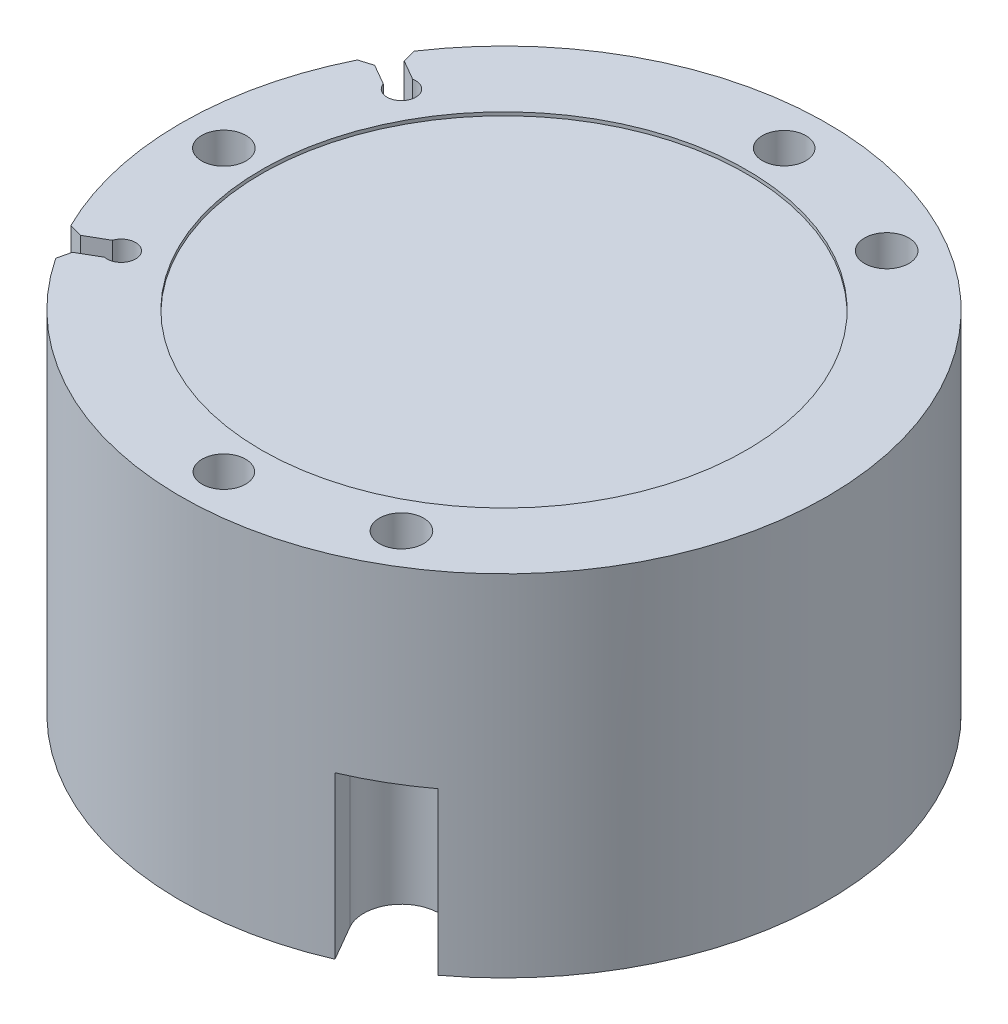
ISO-10303-21;
HEADER;
FILE_DESCRIPTION(('STEP AP214'),'2;1');
FILE_NAME('part.step','',(''),(''),'','','');
FILE_SCHEMA(('AUTOMOTIVE_DESIGN { 1 0 10303 214 1 1 1 1 }'));
ENDSEC;
DATA;
#1=APPLICATION_CONTEXT('core data for automotive mechanical design processes');
#2=APPLICATION_PROTOCOL_DEFINITION('international standard','automotive_design',2000,#1);
#3=PRODUCT_CONTEXT('',#1,'mechanical');
#4=PRODUCT('Part','Part','',(#3));
#5=PRODUCT_RELATED_PRODUCT_CATEGORY('part','',(#4));
#6=PRODUCT_DEFINITION_FORMATION('','',#4);
#7=PRODUCT_DEFINITION_CONTEXT('part definition',#1,'design');
#8=PRODUCT_DEFINITION('design','',#6,#7);
#9=PRODUCT_DEFINITION_SHAPE('','',#8);
#10=(LENGTH_UNIT() NAMED_UNIT(*) SI_UNIT(.MILLI.,.METRE.));
#11=(NAMED_UNIT(*) PLANE_ANGLE_UNIT() SI_UNIT($,.RADIAN.));
#12=(NAMED_UNIT(*) SI_UNIT($,.STERADIAN.) SOLID_ANGLE_UNIT());
#13=UNCERTAINTY_MEASURE_WITH_UNIT(LENGTH_MEASURE(1.E-05),#10,'distance_accuracy_value','');
#14=(GEOMETRIC_REPRESENTATION_CONTEXT(3) GLOBAL_UNCERTAINTY_ASSIGNED_CONTEXT((#13)) GLOBAL_UNIT_ASSIGNED_CONTEXT((#10,
#11,#12)) REPRESENTATION_CONTEXT('',''));
#15=CARTESIAN_POINT('',(0.,0.,0.));
#16=DIRECTION('',(0.,0.,1.));
#17=DIRECTION('',(1.,0.,0.));
#18=AXIS2_PLACEMENT_3D('',#15,#16,#17);
#19=CARTESIAN_POINT('',(0.,-4.699,0.));
#20=DIRECTION('',(0.,-1.,0.));
#21=DIRECTION('',(0.,0.,-1.));
#22=AXIS2_PLACEMENT_3D('',#19,#20,#21);
#23=CYLINDRICAL_SURFACE('',#22,34.925);
#24=CARTESIAN_POINT('',(0.,-4.699,0.));
#25=DIRECTION('',(0.,-1.,0.));
#26=DIRECTION('',(0.,0.,-1.));
#27=AXIS2_PLACEMENT_3D('',#24,#25,#26);
#28=CIRCLE('',#27,34.925);
#29=CARTESIAN_POINT('',(-5.26851171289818,-4.69899999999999,-34.525329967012));
#30=VERTEX_POINT('',#29);
#31=CARTESIAN_POINT('',(32.5340686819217,-4.69899999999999,-12.7));
#32=VERTEX_POINT('',#31);
#33=EDGE_CURVE('E333',#30,#32,#28,.T.);
#34=ORIENTED_EDGE('',*,*,#33,.F.);
#35=DIRECTION('',(0.,-1.,0.));
#36=VECTOR('',#35,1.);
#37=CARTESIAN_POINT('',(-5.26851171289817,-4.699,-34.525329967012));
#38=LINE('',#37,#36);
#39=CARTESIAN_POINT('',(-5.26851171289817,-25.781,-34.525329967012));
#40=VERTEX_POINT('',#39);
#41=EDGE_CURVE('E325',#30,#40,#38,.T.);
#42=ORIENTED_EDGE('',*,*,#41,.T.);
#43=CARTESIAN_POINT('',(0.,-25.781,0.));
#44=DIRECTION('',(0.,-1.,0.));
#45=DIRECTION('',(0.,0.,-1.));
#46=AXIS2_PLACEMENT_3D('',#43,#44,#45);
#47=CIRCLE('',#46,34.925);
#48=CARTESIAN_POINT('',(32.5340686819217,-25.781,-12.7));
#49=VERTEX_POINT('',#48);
#50=EDGE_CURVE('E344',#40,#49,#47,.T.);
#51=ORIENTED_EDGE('',*,*,#50,.T.);
#52=DIRECTION('',(0.,-1.,0.));
#53=VECTOR('',#52,1.);
#54=CARTESIAN_POINT('',(32.5340686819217,-4.699,-12.7));
#55=LINE('',#54,#53);
#56=EDGE_CURVE('E662',#49,#32,#55,.F.);
#57=ORIENTED_EDGE('',*,*,#56,.T.);
#58=EDGE_LOOP('',(#34,#42,#51,#57));
#59=FACE_BOUND('',#58,.T.);
#60=ADVANCED_FACE('F33',(#59),#23,.F.);
#61=CARTESIAN_POINT('',(-27.2655569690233,-25.781,21.8253299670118));
#62=VERTEX_POINT('',#61);
#63=CARTESIAN_POINT('',(-27.265556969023,-25.781,-21.8253299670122));
#64=VERTEX_POINT('',#63);
#65=EDGE_CURVE('E324',#62,#64,#47,.T.);
#66=ORIENTED_EDGE('',*,*,#65,.T.);
#67=DIRECTION('',(0.,-1.,0.));
#68=VECTOR('',#67,1.);
#69=CARTESIAN_POINT('',(-27.265556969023,-4.699,-21.8253299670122));
#70=LINE('',#69,#68);
#71=CARTESIAN_POINT('',(-27.265556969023,-4.69899999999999,-21.8253299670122));
#72=VERTEX_POINT('',#71);
#73=EDGE_CURVE('E308',#64,#72,#70,.F.);
#74=ORIENTED_EDGE('',*,*,#73,.T.);
#75=CARTESIAN_POINT('',(-27.2655569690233,-4.699,21.8253299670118));
#76=VERTEX_POINT('',#75);
#77=EDGE_CURVE('E322',#76,#72,#28,.T.);
#78=ORIENTED_EDGE('',*,*,#77,.F.);
#79=DIRECTION('',(0.,-1.,0.));
#80=VECTOR('',#79,1.);
#81=CARTESIAN_POINT('',(-27.2655569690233,-4.699,21.8253299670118));
#82=LINE('',#81,#80);
#83=EDGE_CURVE('E644',#76,#62,#82,.T.);
#84=ORIENTED_EDGE('',*,*,#83,.T.);
#85=EDGE_LOOP('',(#66,#74,#78,#84));
#86=FACE_BOUND('',#85,.T.);
#87=ADVANCED_FACE('F320',(#86),#23,.F.);
#88=CARTESIAN_POINT('',(0.,25.781,0.));
#89=DIRECTION('',(0.,-1.,0.));
#90=DIRECTION('',(0.,0.,-1.));
#91=AXIS2_PLACEMENT_3D('',#88,#89,#90);
#92=CYLINDRICAL_SURFACE('',#91,47.625);
#93=CARTESIAN_POINT('',(0.,25.781,0.));
#94=DIRECTION('',(0.,1.,0.));
#95=DIRECTION('',(0.,0.,1.));
#96=AXIS2_PLACEMENT_3D('',#93,#94,#95);
#97=CIRCLE('',#96,47.625);
#98=CARTESIAN_POINT('',(-42.7008868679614,25.781,-21.0896867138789));
#99=VERTEX_POINT('',#98);
#100=CARTESIAN_POINT('',(-42.6807000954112,25.781,21.1305102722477));
#101=VERTEX_POINT('',#100);
#102=EDGE_CURVE('E508',#99,#101,#97,.T.);
#103=ORIENTED_EDGE('',*,*,#102,.F.);
#104=DIRECTION('',(0.,-1.,0.));
#105=VECTOR('',#104,1.);
#106=CARTESIAN_POINT('',(-42.7008868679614,25.781,-21.0896867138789));
#107=LINE('',#106,#105);
#108=CARTESIAN_POINT('',(-42.7008868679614,-25.781,-21.0896867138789));
#109=VERTEX_POINT('',#108);
#110=EDGE_CURVE('E533',#99,#109,#107,.T.);
#111=ORIENTED_EDGE('',*,*,#110,.T.);
#112=CARTESIAN_POINT('',(0.,-25.781,0.));
#113=DIRECTION('',(0.,1.,0.));
#114=DIRECTION('',(0.,0.,1.));
#115=AXIS2_PLACEMENT_3D('',#112,#113,#114);
#116=CIRCLE('',#115,47.625);
#117=CARTESIAN_POINT('',(-47.2997749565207,-25.781,-5.55625));
#118=VERTEX_POINT('',#117);
#119=EDGE_CURVE('E501',#109,#118,#116,.T.);
#120=ORIENTED_EDGE('',*,*,#119,.T.);
#121=DIRECTION('',(0.,-1.,0.));
#122=VECTOR('',#121,1.);
#123=CARTESIAN_POINT('',(-47.2997749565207,-1.9812,-5.55625));
#124=LINE('',#123,#122);
#125=CARTESIAN_POINT('',(-47.2997749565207,-1.9812,-5.55625));
#126=VERTEX_POINT('',#125);
#127=EDGE_CURVE('E480',#126,#118,#124,.T.);
#128=ORIENTED_EDGE('',*,*,#127,.F.);
#129=CARTESIAN_POINT('',(0.,-1.9812,0.));
#130=DIRECTION('',(0.,-1.,0.));
#131=DIRECTION('',(0.,0.,-1.));
#132=AXIS2_PLACEMENT_3D('',#129,#130,#131);
#133=CIRCLE('',#132,47.625);
#134=CARTESIAN_POINT('',(-47.2997749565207,-1.9812,5.55625000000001));
#135=VERTEX_POINT('',#134);
#136=EDGE_CURVE('E465',#135,#126,#133,.T.);
#137=ORIENTED_EDGE('',*,*,#136,.F.);
#138=DIRECTION('',(0.,-1.,0.));
#139=VECTOR('',#138,1.);
#140=CARTESIAN_POINT('',(-47.2997749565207,-1.9812,5.55625000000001));
#141=LINE('',#140,#139);
#142=CARTESIAN_POINT('',(-47.2997749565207,-25.781,5.55625000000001));
#143=VERTEX_POINT('',#142);
#144=EDGE_CURVE('E483',#135,#143,#141,.T.);
#145=ORIENTED_EDGE('',*,*,#144,.T.);
#146=CARTESIAN_POINT('',(-42.6807000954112,-25.781,21.1305102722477));
#147=VERTEX_POINT('',#146);
#148=EDGE_CURVE('E509',#143,#147,#116,.T.);
#149=ORIENTED_EDGE('',*,*,#148,.T.);
#150=DIRECTION('',(0.,-1.,0.));
#151=VECTOR('',#150,1.);
#152=CARTESIAN_POINT('',(-42.6807000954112,25.781,21.1305102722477));
#153=LINE('',#152,#151);
#154=EDGE_CURVE('E530',#147,#101,#153,.F.);
#155=ORIENTED_EDGE('',*,*,#154,.T.);
#156=EDGE_LOOP('',(#103,#111,#120,#128,#137,#145,#149,#155));
#157=FACE_BOUND('',#156,.T.);
#158=ADVANCED_FACE('F727',(#157),#92,.T.);
#159=CARTESIAN_POINT('',(20.6374999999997,-25.781,35.7451985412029));
#160=DIRECTION('',(0.,1.,0.));
#161=DIRECTION('',(0.,0.,1.));
#162=AXIS2_PLACEMENT_3D('',#159,#160,#161);
#163=CYLINDRICAL_SURFACE('',#162,3.2639);
#164=CARTESIAN_POINT('',(20.6374999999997,25.781,35.7451985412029));
#165=DIRECTION('',(0.,1.,0.));
#166=DIRECTION('',(0.866025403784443,0.,-0.499999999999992));
#167=AXIS2_PLACEMENT_3D('',#164,#165,#166);
#168=CIRCLE('',#167,3.2639);
#169=CARTESIAN_POINT('',(23.4641203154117,25.781,34.1132485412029));
#170=VERTEX_POINT('',#169);
#171=EDGE_CURVE('E488',#170,#170,#168,.T.);
#172=ORIENTED_EDGE('',*,*,#171,.T.);
#173=EDGE_LOOP('',(#172));
#174=FACE_BOUND('',#173,.T.);
#175=CARTESIAN_POINT('',(20.6374999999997,-1.9812,35.7451985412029));
#176=DIRECTION('',(0.,-1.,0.));
#177=DIRECTION('',(0.,0.,-1.));
#178=AXIS2_PLACEMENT_3D('',#175,#176,#177);
#179=CIRCLE('',#178,3.2639);
#180=CARTESIAN_POINT('',(20.6374999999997,-1.9812,32.4812985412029));
#181=VERTEX_POINT('',#180);
#182=EDGE_CURVE('E419',#181,#181,#179,.F.);
#183=ORIENTED_EDGE('',*,*,#182,.F.);
#184=EDGE_LOOP('',(#183));
#185=FACE_BOUND('',#184,.T.);
#186=ADVANCED_FACE('F995',(#174,#185),#163,.F.);
#187=CARTESIAN_POINT('',(20.6375000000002,-25.781,-35.7451985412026));
#188=DIRECTION('',(0.,1.,0.));
#189=DIRECTION('',(0.,0.,1.));
#190=AXIS2_PLACEMENT_3D('',#187,#188,#189);
#191=CYLINDRICAL_SURFACE('',#190,3.2639);
#192=CARTESIAN_POINT('',(20.6375000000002,25.781,-35.7451985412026));
#193=DIRECTION('',(0.,1.,0.));
#194=DIRECTION('',(-0.866025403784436,0.,-0.500000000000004));
#195=AXIS2_PLACEMENT_3D('',#192,#193,#194);
#196=CIRCLE('',#195,3.2639);
#197=CARTESIAN_POINT('',(17.8108796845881,25.781,-37.3771485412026));
#198=VERTEX_POINT('',#197);
#199=EDGE_CURVE('E491',#198,#198,#196,.T.);
#200=ORIENTED_EDGE('',*,*,#199,.T.);
#201=EDGE_LOOP('',(#200));
#202=FACE_BOUND('',#201,.T.);
#203=CARTESIAN_POINT('',(20.6375000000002,-1.9812,-35.7451985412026));
#204=DIRECTION('',(0.,-1.,0.));
#205=DIRECTION('',(0.,0.,-1.));
#206=AXIS2_PLACEMENT_3D('',#203,#204,#205);
#207=CIRCLE('',#206,3.2639);
#208=CARTESIAN_POINT('',(20.6375000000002,-1.9812,-39.0090985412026));
#209=VERTEX_POINT('',#208);
#210=EDGE_CURVE('E449',#209,#209,#207,.F.);
#211=ORIENTED_EDGE('',*,*,#210,.F.);
#212=EDGE_LOOP('',(#211));
#213=FACE_BOUND('',#212,.T.);
#214=ADVANCED_FACE('F1136',(#202,#213),#191,.F.);
#215=CARTESIAN_POINT('',(-41.275,-25.781,0.));
#216=DIRECTION('',(0.,1.,0.));
#217=DIRECTION('',(0.,0.,1.));
#218=AXIS2_PLACEMENT_3D('',#215,#216,#217);
#219=CYLINDRICAL_SURFACE('',#218,3.2639);
#220=CARTESIAN_POINT('',(-41.275,25.781,0.));
#221=DIRECTION('',(0.,1.,0.));
#222=DIRECTION('',(0.,0.,1.));
#223=AXIS2_PLACEMENT_3D('',#220,#221,#222);
#224=CIRCLE('',#223,3.2639);
#225=CARTESIAN_POINT('',(-41.275,25.781,3.2639));
#226=VERTEX_POINT('',#225);
#227=EDGE_CURVE('E494',#226,#226,#224,.T.);
#228=ORIENTED_EDGE('',*,*,#227,.T.);
#229=EDGE_LOOP('',(#228));
#230=FACE_BOUND('',#229,.T.);
#231=CARTESIAN_POINT('',(-41.275,-1.9812,0.));
#232=DIRECTION('',(0.,-1.,0.));
#233=DIRECTION('',(0.,0.,-1.));
#234=AXIS2_PLACEMENT_3D('',#231,#232,#233);
#235=CIRCLE('',#234,3.2639);
#236=CARTESIAN_POINT('',(-41.275,-1.9812,-3.2639));
#237=VERTEX_POINT('',#236);
#238=EDGE_CURVE('E479',#237,#237,#235,.F.);
#239=ORIENTED_EDGE('',*,*,#238,.F.);
#240=EDGE_LOOP('',(#239));
#241=FACE_BOUND('',#240,.T.);
#242=ADVANCED_FACE('F986',(#230,#241),#219,.F.);
#243=CARTESIAN_POINT('',(18.8380338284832,-25.781,-43.7409317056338));
#244=VERTEX_POINT('',#243);
#245=CARTESIAN_POINT('',(-39.6399087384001,-25.781,-26.3973153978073));
#246=VERTEX_POINT('',#245);
#247=EDGE_CURVE('E513',#244,#246,#116,.T.);
#248=ORIENTED_EDGE('',*,*,#247,.T.);
#249=DIRECTION('',(0.,-1.,0.));
#250=VECTOR('',#249,1.);
#251=CARTESIAN_POINT('',(-39.6399087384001,25.781,-26.3973153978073));
#252=LINE('',#251,#250);
#253=CARTESIAN_POINT('',(-39.6399087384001,25.781,-26.3973153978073));
#254=VERTEX_POINT('',#253);
#255=EDGE_CURVE('E545',#246,#254,#252,.F.);
#256=ORIENTED_EDGE('',*,*,#255,.T.);
#257=CARTESIAN_POINT('',(-39.614647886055,25.781,26.4352094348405));
#258=VERTEX_POINT('',#257);
#259=EDGE_CURVE('E504',#258,#254,#97,.T.);
#260=ORIENTED_EDGE('',*,*,#259,.F.);
#261=DIRECTION('',(0.,-1.,0.));
#262=VECTOR('',#261,1.);
#263=CARTESIAN_POINT('',(-39.614647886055,25.781,26.4352094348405));
#264=LINE('',#263,#262);
#265=CARTESIAN_POINT('',(-39.614647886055,-25.781,26.4352094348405));
#266=VERTEX_POINT('',#265);
#267=EDGE_CURVE('E543',#258,#266,#264,.T.);
#268=ORIENTED_EDGE('',*,*,#267,.T.);
#269=CARTESIAN_POINT('',(18.8380338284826,-25.781,43.7409317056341));
#270=VERTEX_POINT('',#269);
#271=EDGE_CURVE('E512',#266,#270,#116,.T.);
#272=ORIENTED_EDGE('',*,*,#271,.T.);
#273=DIRECTION('',(0.,-1.,0.));
#274=VECTOR('',#273,1.);
#275=CARTESIAN_POINT('',(18.8380338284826,-1.9812,43.7409317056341));
#276=LINE('',#275,#274);
#277=CARTESIAN_POINT('',(18.8380338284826,-1.9812,43.7409317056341));
#278=VERTEX_POINT('',#277);
#279=EDGE_CURVE('E420',#278,#270,#276,.T.);
#280=ORIENTED_EDGE('',*,*,#279,.F.);
#281=CARTESIAN_POINT('',(0.,-1.9812,0.));
#282=DIRECTION('',(0.,-1.,0.));
#283=DIRECTION('',(-0.866025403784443,0.,0.499999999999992));
#284=AXIS2_PLACEMENT_3D('',#281,#282,#283);
#285=CIRCLE('',#284,47.625);
#286=CARTESIAN_POINT('',(28.4617411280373,-1.9812,38.1846817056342));
#287=VERTEX_POINT('',#286);
#288=EDGE_CURVE('E406',#287,#278,#285,.T.);
#289=ORIENTED_EDGE('',*,*,#288,.F.);
#290=DIRECTION('',(0.,-1.,0.));
#291=VECTOR('',#290,1.);
#292=CARTESIAN_POINT('',(28.4617411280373,-1.9812,38.1846817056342));
#293=LINE('',#292,#291);
#294=CARTESIAN_POINT('',(28.4617411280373,-25.781,38.1846817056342));
#295=VERTEX_POINT('',#294);
#296=EDGE_CURVE('E423',#287,#295,#293,.T.);
#297=ORIENTED_EDGE('',*,*,#296,.T.);
#298=CARTESIAN_POINT('',(28.4617411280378,-25.781,-38.1846817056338));
#299=VERTEX_POINT('',#298);
#300=EDGE_CURVE('E1250',#295,#299,#116,.T.);
#301=ORIENTED_EDGE('',*,*,#300,.T.);
#302=DIRECTION('',(0.,-1.,0.));
#303=VECTOR('',#302,1.);
#304=CARTESIAN_POINT('',(28.4617411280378,-1.9812,-38.1846817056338));
#305=LINE('',#304,#303);
#306=CARTESIAN_POINT('',(28.4617411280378,-1.9812,-38.1846817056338));
#307=VERTEX_POINT('',#306);
#308=EDGE_CURVE('E450',#307,#299,#305,.T.);
#309=ORIENTED_EDGE('',*,*,#308,.F.);
#310=CARTESIAN_POINT('',(0.,-1.9812,0.));
#311=DIRECTION('',(0.,-1.,0.));
#312=DIRECTION('',(0.866025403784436,0.,0.500000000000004));
#313=AXIS2_PLACEMENT_3D('',#310,#311,#312);
#314=CIRCLE('',#313,47.625);
#315=CARTESIAN_POINT('',(18.8380338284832,-1.9812,-43.7409317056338));
#316=VERTEX_POINT('',#315);
#317=EDGE_CURVE('E435',#316,#307,#314,.T.);
#318=ORIENTED_EDGE('',*,*,#317,.F.);
#319=DIRECTION('',(0.,-1.,0.));
#320=VECTOR('',#319,1.);
#321=CARTESIAN_POINT('',(18.8380338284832,-1.9812,-43.7409317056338));
#322=LINE('',#321,#320);
#323=EDGE_CURVE('E453',#316,#244,#322,.T.);
#324=ORIENTED_EDGE('',*,*,#323,.T.);
#325=EDGE_LOOP('',(#248,#256,#260,#268,#272,#280,#289,#297,#301,#309,#318,#324));
#326=FACE_BOUND('',#325,.T.);
#327=ADVANCED_FACE('F976',(#326),#92,.T.);
#328=CARTESIAN_POINT('',(0.,25.781,0.));
#329=DIRECTION('',(0.,1.,0.));
#330=DIRECTION('',(0.,0.,1.));
#331=AXIS2_PLACEMENT_3D('',#328,#329,#330);
#332=PLANE('',#331);
#333=DIRECTION('',(0.866025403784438,0.,0.500000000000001));
#334=VECTOR('',#333,1.);
#335=CARTESIAN_POINT('',(-37.7403074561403,25.781,-19.9562895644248));
#336=LINE('',#335,#334);
#337=CARTESIAN_POINT('',(-40.7373548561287,25.781,-21.6866356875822));
#338=VERTEX_POINT('',#337);
#339=CARTESIAN_POINT('',(-37.7403074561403,25.781,-19.9562895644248));
#340=VERTEX_POINT('',#339);
#341=EDGE_CURVE('E349',#338,#340,#336,.T.);
#342=ORIENTED_EDGE('',*,*,#341,.F.);
#343=DIRECTION('',(-0.956761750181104,0.,0.290872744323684));
#344=VECTOR('',#343,1.);
#345=CARTESIAN_POINT('',(-9.48196562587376,25.781,-31.1888349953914));
#346=LINE('',#345,#344);
#347=EDGE_CURVE('E528',#338,#99,#346,.T.);
#348=ORIENTED_EDGE('',*,*,#347,.T.);
#349=ORIENTED_EDGE('',*,*,#102,.T.);
#350=DIRECTION('',(0.96592582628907,0.,0.258819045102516));
#351=VECTOR('',#350,1.);
#352=CARTESIAN_POINT('',(-8.1416923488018,25.781,30.3852095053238));
#353=LINE('',#352,#351);
#354=CARTESIAN_POINT('',(-40.6954671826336,25.781,21.6624518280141));
#355=VERTEX_POINT('',#354);
#356=EDGE_CURVE('E524',#101,#355,#353,.T.);
#357=ORIENTED_EDGE('',*,*,#356,.T.);
#358=DIRECTION('',(-0.866025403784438,0.,0.500000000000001));
#359=VECTOR('',#358,1.);
#360=CARTESIAN_POINT('',(-37.7403074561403,25.781,19.9562895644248));
#361=LINE('',#360,#359);
#362=CARTESIAN_POINT('',(-37.7403074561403,25.781,19.9562895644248));
#363=VERTEX_POINT('',#362);
#364=EDGE_CURVE('E369',#363,#355,#361,.T.);
#365=ORIENTED_EDGE('',*,*,#364,.F.);
#366=CARTESIAN_POINT('',(-35.7451985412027,25.781,20.6375));
#367=DIRECTION('',(0.,1.,0.));
#368=DIRECTION('',(0.,0.,-1.));
#369=AXIS2_PLACEMENT_3D('',#366,#367,#368);
#370=CIRCLE('',#369,2.1082);
#371=CARTESIAN_POINT('',(-36.1528074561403,25.781,22.7059202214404));
#372=VERTEX_POINT('',#371);
#373=EDGE_CURVE('E377',#372,#363,#370,.T.);
#374=ORIENTED_EDGE('',*,*,#373,.F.);
#375=DIRECTION('',(0.866025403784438,0.,-0.500000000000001));
#376=VECTOR('',#375,1.);
#377=CARTESIAN_POINT('',(-36.1528074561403,25.781,22.7059202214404));
#378=LINE('',#377,#376);
#379=CARTESIAN_POINT('',(-39.1498548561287,25.781,24.4362663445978));
#380=VERTEX_POINT('',#379);
#381=EDGE_CURVE('E364',#380,#372,#378,.T.);
#382=ORIENTED_EDGE('',*,*,#381,.F.);
#383=DIRECTION('',(-0.226477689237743,0.,0.974016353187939));
#384=VECTOR('',#383,1.);
#385=CARTESIAN_POINT('',(-31.751306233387,25.781,-7.38279438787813));
#386=LINE('',#385,#384);
#387=EDGE_CURVE('E522',#380,#258,#386,.T.);
#388=ORIENTED_EDGE('',*,*,#387,.T.);
#389=ORIENTED_EDGE('',*,*,#259,.T.);
#390=DIRECTION('',(0.258819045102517,0.,0.965925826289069));
#391=VECTOR('',#390,1.);
#392=CARTESIAN_POINT('',(-30.385209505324,25.781,8.14169234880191));
#393=LINE('',#392,#391);
#394=CARTESIAN_POINT('',(-39.1079671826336,25.781,-24.4120824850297));
#395=VERTEX_POINT('',#394);
#396=EDGE_CURVE('E526',#254,#395,#393,.T.);
#397=ORIENTED_EDGE('',*,*,#396,.T.);
#398=DIRECTION('',(-0.866025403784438,0.,-0.500000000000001));
#399=VECTOR('',#398,1.);
#400=CARTESIAN_POINT('',(-36.1528074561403,25.781,-22.7059202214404));
#401=LINE('',#400,#399);
#402=CARTESIAN_POINT('',(-36.1528074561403,25.781,-22.7059202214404));
#403=VERTEX_POINT('',#402);
#404=EDGE_CURVE('E357',#403,#395,#401,.T.);
#405=ORIENTED_EDGE('',*,*,#404,.F.);
#406=CARTESIAN_POINT('',(-35.7451985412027,25.781,-20.6375));
#407=DIRECTION('',(0.,1.,0.));
#408=DIRECTION('',(0.,0.,1.));
#409=AXIS2_PLACEMENT_3D('',#406,#407,#408);
#410=CIRCLE('',#409,2.1082);
#411=EDGE_CURVE('E336',#340,#403,#410,.T.);
#412=ORIENTED_EDGE('',*,*,#411,.F.);
#413=EDGE_LOOP('',(#342,#348,#349,#357,#365,#374,#382,#388,#389,#397,#405,#412));
#414=FACE_BOUND('',#413,.T.);
#415=CARTESIAN_POINT('',(0.,25.781,-41.275));
#416=DIRECTION('',(0.,1.,0.));
#417=DIRECTION('',(0.,0.,1.));
#418=AXIS2_PLACEMENT_3D('',#415,#416,#417);
#419=CIRCLE('',#418,3.20675);
#420=CARTESIAN_POINT('',(0.,25.781,-38.06825));
#421=VERTEX_POINT('',#420);
#422=EDGE_CURVE('E384',#421,#421,#419,.T.);
#423=ORIENTED_EDGE('',*,*,#422,.F.);
#424=EDGE_LOOP('',(#423));
#425=FACE_BOUND('',#424,.T.);
#426=CARTESIAN_POINT('',(0.,25.781,41.275));
#427=DIRECTION('',(0.,1.,0.));
#428=DIRECTION('',(0.,0.,1.));
#429=AXIS2_PLACEMENT_3D('',#426,#427,#428);
#430=CIRCLE('',#429,3.20675);
#431=CARTESIAN_POINT('',(0.,25.781,44.48175));
#432=VERTEX_POINT('',#431);
#433=EDGE_CURVE('E392',#432,#432,#430,.T.);
#434=ORIENTED_EDGE('',*,*,#433,.F.);
#435=EDGE_LOOP('',(#434));
#436=FACE_BOUND('',#435,.T.);
#437=ORIENTED_EDGE('',*,*,#171,.F.);
#438=EDGE_LOOP('',(#437));
#439=FACE_BOUND('',#438,.T.);
#440=ORIENTED_EDGE('',*,*,#199,.F.);
#441=EDGE_LOOP('',(#440));
#442=FACE_BOUND('',#441,.T.);
#443=ORIENTED_EDGE('',*,*,#227,.F.);
#444=EDGE_LOOP('',(#443));
#445=FACE_BOUND('',#444,.T.);
#446=CARTESIAN_POINT('',(0.,25.781,0.));
#447=DIRECTION('',(0.,1.,0.));
#448=DIRECTION('',(0.,0.,1.));
#449=AXIS2_PLACEMENT_3D('',#446,#447,#448);
#450=CIRCLE('',#449,35.7505);
#451=CARTESIAN_POINT('',(0.,25.781,35.7505));
#452=VERTEX_POINT('',#451);
#453=EDGE_CURVE('E497',#452,#452,#450,.T.);
#454=ORIENTED_EDGE('',*,*,#453,.F.);
#455=EDGE_LOOP('',(#454));
#456=FACE_BOUND('',#455,.T.);
#457=ADVANCED_FACE('F836',(#414,#425,#436,#439,#442,#445,#456),#332,.T.);
#458=CARTESIAN_POINT('',(0.,-25.781,0.));
#459=DIRECTION('',(0.,1.,0.));
#460=DIRECTION('',(0.,0.,1.));
#461=AXIS2_PLACEMENT_3D('',#458,#459,#460);
#462=PLANE('',#461);
#463=ORIENTED_EDGE('',*,*,#50,.F.);
#464=DIRECTION('',(0.499999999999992,0.,0.866025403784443));
#465=VECTOR('',#464,1.);
#466=CARTESIAN_POINT('',(1.47352262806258,-25.781,-22.8477839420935));
#467=LINE('',#466,#465);
#468=CARTESIAN_POINT('',(-8.05147737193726,-25.781,-39.3455678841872));
#469=VERTEX_POINT('',#468);
#470=EDGE_CURVE('E620',#469,#40,#467,.T.);
#471=ORIENTED_EDGE('',*,*,#470,.F.);
#472=CARTESIAN_POINT('',(-13.5507386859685,-25.781,-36.1705678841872));
#473=DIRECTION('',(0.,1.,0.));
#474=DIRECTION('',(0.,0.,1.));
#475=AXIS2_PLACEMENT_3D('',#472,#473,#474);
#476=CIRCLE('',#475,6.35);
#477=CARTESIAN_POINT('',(-16.7257386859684,-25.781,-41.6698291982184));
#478=VERTEX_POINT('',#477);
#479=EDGE_CURVE('E600',#469,#478,#476,.T.);
#480=ORIENTED_EDGE('',*,*,#479,.T.);
#481=DIRECTION('',(0.866025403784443,0.,-0.499999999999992));
#482=VECTOR('',#481,1.);
#483=CARTESIAN_POINT('',(-11.2264773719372,-25.781,-44.8448291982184));
#484=LINE('',#483,#482);
#485=CARTESIAN_POINT('',(-27.7242613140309,-25.781,-35.3198291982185));
#486=VERTEX_POINT('',#485);
#487=EDGE_CURVE('E609',#486,#478,#484,.T.);
#488=ORIENTED_EDGE('',*,*,#487,.F.);
#489=CARTESIAN_POINT('',(-24.5492613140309,-25.781,-29.8205678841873));
#490=DIRECTION('',(0.,1.,0.));
#491=DIRECTION('',(0.,0.,1.));
#492=AXIS2_PLACEMENT_3D('',#489,#490,#491);
#493=CIRCLE('',#492,6.35);
#494=CARTESIAN_POINT('',(-30.0485226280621,-25.781,-26.6455678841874));
#495=VERTEX_POINT('',#494);
#496=EDGE_CURVE('E602',#486,#495,#493,.T.);
#497=ORIENTED_EDGE('',*,*,#496,.T.);
#498=DIRECTION('',(-0.499999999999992,0.,-0.866025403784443));
#499=VECTOR('',#498,1.);
#500=CARTESIAN_POINT('',(-20.5235226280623,-25.781,-10.1477839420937));
#501=LINE('',#500,#499);
#502=EDGE_CURVE('E607',#64,#495,#501,.T.);
#503=ORIENTED_EDGE('',*,*,#502,.F.);
#504=ORIENTED_EDGE('',*,*,#65,.F.);
#505=DIRECTION('',(0.500000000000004,0.,-0.866025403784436));
#506=VECTOR('',#505,1.);
#507=CARTESIAN_POINT('',(-20.5235226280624,-25.781,10.1477839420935));
#508=LINE('',#507,#506);
#509=CARTESIAN_POINT('',(-30.0485226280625,-25.781,26.645567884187));
#510=VERTEX_POINT('',#509);
#511=EDGE_CURVE('E633',#510,#62,#508,.T.);
#512=ORIENTED_EDGE('',*,*,#511,.F.);
#513=CARTESIAN_POINT('',(-24.5492613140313,-25.781,29.820567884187));
#514=DIRECTION('',(0.,1.,0.));
#515=DIRECTION('',(0.,0.,1.));
#516=AXIS2_PLACEMENT_3D('',#513,#514,#515);
#517=CIRCLE('',#516,6.35);
#518=CARTESIAN_POINT('',(-27.7242613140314,-25.781,35.3198291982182));
#519=VERTEX_POINT('',#518);
#520=EDGE_CURVE('E41',#510,#519,#517,.T.);
#521=ORIENTED_EDGE('',*,*,#520,.T.);
#522=DIRECTION('',(-0.866025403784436,0.,-0.500000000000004));
#523=VECTOR('',#522,1.);
#524=CARTESIAN_POINT('',(-33.2235226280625,-25.781,32.1448291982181));
#525=LINE('',#524,#523);
#526=CARTESIAN_POINT('',(-16.725738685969,-25.781,41.6698291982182));
#527=VERTEX_POINT('',#526);
#528=EDGE_CURVE('E637',#527,#519,#525,.T.);
#529=ORIENTED_EDGE('',*,*,#528,.F.);
#530=CARTESIAN_POINT('',(-13.550738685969,-25.781,36.1705678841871));
#531=DIRECTION('',(0.,1.,0.));
#532=DIRECTION('',(0.,0.,1.));
#533=AXIS2_PLACEMENT_3D('',#530,#531,#532);
#534=CIRCLE('',#533,6.35);
#535=CARTESIAN_POINT('',(-8.05147737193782,-25.781,39.3455678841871));
#536=VERTEX_POINT('',#535);
#537=EDGE_CURVE('E11',#527,#536,#534,.T.);
#538=ORIENTED_EDGE('',*,*,#537,.T.);
#539=DIRECTION('',(-0.500000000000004,0.,0.866025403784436));
#540=VECTOR('',#539,1.);
#541=CARTESIAN_POINT('',(1.47352262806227,-25.781,22.8477839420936));
#542=LINE('',#541,#540);
#543=CARTESIAN_POINT('',(-5.26851171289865,-25.781,34.5253299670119));
#544=VERTEX_POINT('',#543);
#545=EDGE_CURVE('E629',#544,#536,#542,.T.);
#546=ORIENTED_EDGE('',*,*,#545,.F.);
#547=CARTESIAN_POINT('',(32.5340686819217,-25.781,12.7));
#548=VERTEX_POINT('',#547);
#549=EDGE_CURVE('E337',#548,#544,#47,.T.);
#550=ORIENTED_EDGE('',*,*,#549,.F.);
#551=DIRECTION('',(-1.,0.,0.));
#552=VECTOR('',#551,1.);
#553=CARTESIAN_POINT('',(19.05,-25.781,12.7));
#554=LINE('',#553,#552);
#555=CARTESIAN_POINT('',(38.1,-25.781,12.7));
#556=VERTEX_POINT('',#555);
#557=EDGE_CURVE('E651',#556,#548,#554,.T.);
#558=ORIENTED_EDGE('',*,*,#557,.F.);
#559=CARTESIAN_POINT('',(38.1,-25.781,6.35));
#560=DIRECTION('',(0.,1.,0.));
#561=DIRECTION('',(0.,0.,1.));
#562=AXIS2_PLACEMENT_3D('',#559,#560,#561);
#563=CIRCLE('',#562,6.35);
#564=CARTESIAN_POINT('',(44.45,-25.781,6.35));
#565=VERTEX_POINT('',#564);
#566=EDGE_CURVE('E571',#556,#565,#563,.T.);
#567=ORIENTED_EDGE('',*,*,#566,.T.);
#568=DIRECTION('',(0.,0.,1.));
#569=VECTOR('',#568,1.);
#570=CARTESIAN_POINT('',(44.45,-25.781,12.7));
#571=LINE('',#570,#569);
#572=CARTESIAN_POINT('',(44.45,-25.781,-6.35));
#573=VERTEX_POINT('',#572);
#574=EDGE_CURVE('E657',#573,#565,#571,.T.);
#575=ORIENTED_EDGE('',*,*,#574,.F.);
#576=CARTESIAN_POINT('',(38.1,-25.781,-6.35));
#577=DIRECTION('',(0.,1.,0.));
#578=DIRECTION('',(0.,0.,1.));
#579=AXIS2_PLACEMENT_3D('',#576,#577,#578);
#580=CIRCLE('',#579,6.35);
#581=CARTESIAN_POINT('',(38.1,-25.781,-12.7));
#582=VERTEX_POINT('',#581);
#583=EDGE_CURVE('E569',#573,#582,#580,.T.);
#584=ORIENTED_EDGE('',*,*,#583,.T.);
#585=DIRECTION('',(1.,0.,0.));
#586=VECTOR('',#585,1.);
#587=CARTESIAN_POINT('',(19.05,-25.781,-12.7));
#588=LINE('',#587,#586);
#589=EDGE_CURVE('E646',#49,#582,#588,.T.);
#590=ORIENTED_EDGE('',*,*,#589,.F.);
#591=EDGE_LOOP('',(#463,#471,#480,#488,#497,#503,#504,#512,#521,#529,#538,#546,#550,#558,#567,
#575,#584,#590));
#592=FACE_BOUND('',#591,.T.);
#593=ORIENTED_EDGE('',*,*,#119,.F.);
#594=DIRECTION('',(0.956761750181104,0.,-0.290872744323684));
#595=VECTOR('',#594,1.);
#596=CARTESIAN_POINT('',(-40.7373548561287,-25.781,-21.6866356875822));
#597=LINE('',#596,#595);
#598=CARTESIAN_POINT('',(-40.7373548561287,-25.781,-21.6866356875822));
#599=VERTEX_POINT('',#598);
#600=EDGE_CURVE('E541',#109,#599,#597,.T.);
#601=ORIENTED_EDGE('',*,*,#600,.T.);
#602=DIRECTION('',(0.866025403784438,0.,0.500000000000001));
#603=VECTOR('',#602,1.);
#604=CARTESIAN_POINT('',(-37.7403074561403,-25.781,-19.9562895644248));
#605=LINE('',#604,#603);
#606=CARTESIAN_POINT('',(-37.7403074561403,-25.781,-19.9562895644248));
#607=VERTEX_POINT('',#606);
#608=EDGE_CURVE('E352',#599,#607,#605,.T.);
#609=ORIENTED_EDGE('',*,*,#608,.T.);
#610=CARTESIAN_POINT('',(-35.7451985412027,-25.781,-20.6375));
#611=DIRECTION('',(0.,1.,0.));
#612=DIRECTION('',(0.,0.,1.));
#613=AXIS2_PLACEMENT_3D('',#610,#611,#612);
#614=CIRCLE('',#613,2.1082);
#615=CARTESIAN_POINT('',(-36.1528074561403,-25.781,-22.7059202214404));
#616=VERTEX_POINT('',#615);
#617=EDGE_CURVE('E345',#607,#616,#614,.T.);
#618=ORIENTED_EDGE('',*,*,#617,.T.);
#619=DIRECTION('',(-0.866025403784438,0.,-0.500000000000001));
#620=VECTOR('',#619,1.);
#621=CARTESIAN_POINT('',(-36.1528074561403,-25.781,-22.7059202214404));
#622=LINE('',#621,#620);
#623=CARTESIAN_POINT('',(-39.1079671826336,-25.781,-24.4120824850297));
#624=VERTEX_POINT('',#623);
#625=EDGE_CURVE('E348',#616,#624,#622,.T.);
#626=ORIENTED_EDGE('',*,*,#625,.T.);
#627=DIRECTION('',(-0.258819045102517,0.,-0.965925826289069));
#628=VECTOR('',#627,1.);
#629=CARTESIAN_POINT('',(-39.6399087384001,-25.781,-26.3973153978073));
#630=LINE('',#629,#628);
#631=EDGE_CURVE('E539',#624,#246,#630,.T.);
#632=ORIENTED_EDGE('',*,*,#631,.T.);
#633=ORIENTED_EDGE('',*,*,#247,.F.);
#634=DIRECTION('',(0.500000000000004,0.,-0.866025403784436));
#635=VECTOR('',#634,1.);
#636=CARTESIAN_POINT('',(15.8256463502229,-25.781,-38.5233235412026));
#637=LINE('',#636,#635);
#638=CARTESIAN_POINT('',(15.8256463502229,-25.781,-38.5233235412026));
#639=VERTEX_POINT('',#638);
#640=EDGE_CURVE('E443',#639,#244,#637,.T.);
#641=ORIENTED_EDGE('',*,*,#640,.F.);
#642=CARTESIAN_POINT('',(20.6375000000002,-25.781,-35.7451985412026));
#643=DIRECTION('',(0.,-1.,0.));
#644=DIRECTION('',(0.866025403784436,0.,0.500000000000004));
#645=AXIS2_PLACEMENT_3D('',#642,#643,#644);
#646=CIRCLE('',#645,5.55625);
#647=CARTESIAN_POINT('',(25.4493536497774,-25.781,-32.9670735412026));
#648=VERTEX_POINT('',#647);
#649=EDGE_CURVE('E441',#648,#639,#646,.T.);
#650=ORIENTED_EDGE('',*,*,#649,.F.);
#651=DIRECTION('',(-0.500000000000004,0.,0.866025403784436));
#652=VECTOR('',#651,1.);
#653=CARTESIAN_POINT('',(25.4493536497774,-25.781,-32.9670735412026));
#654=LINE('',#653,#652);
#655=EDGE_CURVE('E432',#299,#648,#654,.T.);
#656=ORIENTED_EDGE('',*,*,#655,.F.);
#657=ORIENTED_EDGE('',*,*,#300,.F.);
#658=DIRECTION('',(0.499999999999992,0.,0.866025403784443));
#659=VECTOR('',#658,1.);
#660=CARTESIAN_POINT('',(25.449353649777,-25.781,32.9670735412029));
#661=LINE('',#660,#659);
#662=CARTESIAN_POINT('',(25.449353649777,-25.781,32.9670735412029));
#663=VERTEX_POINT('',#662);
#664=EDGE_CURVE('E413',#663,#295,#661,.T.);
#665=ORIENTED_EDGE('',*,*,#664,.F.);
#666=CARTESIAN_POINT('',(20.6374999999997,-25.781,35.7451985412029));
#667=DIRECTION('',(0.,-1.,0.));
#668=DIRECTION('',(-0.866025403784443,0.,0.499999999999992));
#669=AXIS2_PLACEMENT_3D('',#666,#667,#668);
#670=CIRCLE('',#669,5.55625);
#671=CARTESIAN_POINT('',(15.8256463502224,-25.781,38.5233235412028));
#672=VERTEX_POINT('',#671);
#673=EDGE_CURVE('E398',#672,#663,#670,.T.);
#674=ORIENTED_EDGE('',*,*,#673,.F.);
#675=DIRECTION('',(-0.499999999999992,0.,-0.866025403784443));
#676=VECTOR('',#675,1.);
#677=CARTESIAN_POINT('',(15.8256463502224,-25.781,38.5233235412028));
#678=LINE('',#677,#676);
#679=EDGE_CURVE('E403',#270,#672,#678,.T.);
#680=ORIENTED_EDGE('',*,*,#679,.F.);
#681=ORIENTED_EDGE('',*,*,#271,.F.);
#682=DIRECTION('',(0.226477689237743,0.,-0.974016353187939));
#683=VECTOR('',#682,1.);
#684=CARTESIAN_POINT('',(-39.1498548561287,-25.781,24.4362663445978));
#685=LINE('',#684,#683);
#686=CARTESIAN_POINT('',(-39.1498548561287,-25.781,24.4362663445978));
#687=VERTEX_POINT('',#686);
#688=EDGE_CURVE('E535',#266,#687,#685,.T.);
#689=ORIENTED_EDGE('',*,*,#688,.T.);
#690=DIRECTION('',(0.866025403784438,0.,-0.500000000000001));
#691=VECTOR('',#690,1.);
#692=CARTESIAN_POINT('',(-36.1528074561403,-25.781,22.7059202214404));
#693=LINE('',#692,#691);
#694=CARTESIAN_POINT('',(-36.1528074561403,-25.781,22.7059202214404));
#695=VERTEX_POINT('',#694);
#696=EDGE_CURVE('E366',#687,#695,#693,.T.);
#697=ORIENTED_EDGE('',*,*,#696,.T.);
#698=CARTESIAN_POINT('',(-35.7451985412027,-25.781,20.6375));
#699=DIRECTION('',(0.,1.,0.));
#700=DIRECTION('',(0.,0.,-1.));
#701=AXIS2_PLACEMENT_3D('',#698,#699,#700);
#702=CIRCLE('',#701,2.1082);
#703=CARTESIAN_POINT('',(-37.7403074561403,-25.781,19.9562895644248));
#704=VERTEX_POINT('',#703);
#705=EDGE_CURVE('E368',#695,#704,#702,.T.);
#706=ORIENTED_EDGE('',*,*,#705,.T.);
#707=DIRECTION('',(-0.866025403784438,0.,0.500000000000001));
#708=VECTOR('',#707,1.);
#709=CARTESIAN_POINT('',(-37.7403074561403,-25.781,19.9562895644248));
#710=LINE('',#709,#708);
#711=CARTESIAN_POINT('',(-40.6954671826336,-25.781,21.6624518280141));
#712=VERTEX_POINT('',#711);
#713=EDGE_CURVE('E372',#704,#712,#710,.T.);
#714=ORIENTED_EDGE('',*,*,#713,.T.);
#715=DIRECTION('',(-0.96592582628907,0.,-0.258819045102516));
#716=VECTOR('',#715,1.);
#717=CARTESIAN_POINT('',(-42.6807000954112,-25.781,21.1305102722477));
#718=LINE('',#717,#716);
#719=EDGE_CURVE('E537',#712,#147,#718,.T.);
#720=ORIENTED_EDGE('',*,*,#719,.T.);
#721=ORIENTED_EDGE('',*,*,#148,.F.);
#722=DIRECTION('',(-1.,0.,0.));
#723=VECTOR('',#722,1.);
#724=CARTESIAN_POINT('',(-41.275,-25.781,5.55625));
#725=LINE('',#724,#723);
#726=CARTESIAN_POINT('',(-41.275,-25.781,5.55625));
#727=VERTEX_POINT('',#726);
#728=EDGE_CURVE('E473',#727,#143,#725,.T.);
#729=ORIENTED_EDGE('',*,*,#728,.F.);
#730=CARTESIAN_POINT('',(-41.275,-25.781,0.));
#731=DIRECTION('',(0.,-1.,0.));
#732=DIRECTION('',(0.,0.,-1.));
#733=AXIS2_PLACEMENT_3D('',#730,#731,#732);
#734=CIRCLE('',#733,5.55625);
#735=CARTESIAN_POINT('',(-41.275,-25.781,-5.55625));
#736=VERTEX_POINT('',#735);
#737=EDGE_CURVE('E471',#736,#727,#734,.T.);
#738=ORIENTED_EDGE('',*,*,#737,.F.);
#739=DIRECTION('',(1.,0.,0.));
#740=VECTOR('',#739,1.);
#741=CARTESIAN_POINT('',(-41.275,-25.781,-5.55625));
#742=LINE('',#741,#740);
#743=EDGE_CURVE('E462',#118,#736,#742,.T.);
#744=ORIENTED_EDGE('',*,*,#743,.F.);
#745=EDGE_LOOP('',(#593,#601,#609,#618,#626,#632,#633,#641,#650,#656,#657,#665,#674,#680,#681,
#689,#697,#706,#714,#720,#721,#729,#738,#744));
#746=FACE_BOUND('',#745,.T.);
#747=ADVANCED_FACE('F605',(#592,#746),#462,.F.);
#748=CARTESIAN_POINT('',(0.,25.273,0.));
#749=DIRECTION('',(0.,1.,0.));
#750=DIRECTION('',(0.,0.,1.));
#751=AXIS2_PLACEMENT_3D('',#748,#749,#750);
#752=CYLINDRICAL_SURFACE('',#751,35.7505);
#753=CARTESIAN_POINT('',(0.,25.273,0.));
#754=DIRECTION('',(0.,1.,0.));
#755=DIRECTION('',(0.,0.,1.));
#756=AXIS2_PLACEMENT_3D('',#753,#754,#755);
#757=CIRCLE('',#756,35.7505);
#758=CARTESIAN_POINT('',(0.,25.273,35.7505));
#759=VERTEX_POINT('',#758);
#760=EDGE_CURVE('E498',#759,#759,#757,.T.);
#761=ORIENTED_EDGE('',*,*,#760,.F.);
#762=EDGE_LOOP('',(#761));
#763=FACE_BOUND('',#762,.T.);
#764=ORIENTED_EDGE('',*,*,#453,.T.);
#765=EDGE_LOOP('',(#764));
#766=FACE_BOUND('',#765,.T.);
#767=ADVANCED_FACE('F835',(#763,#766),#752,.F.);
#768=CARTESIAN_POINT('',(0.,25.273,0.));
#769=DIRECTION('',(0.,1.,0.));
#770=DIRECTION('',(0.,0.,1.));
#771=AXIS2_PLACEMENT_3D('',#768,#769,#770);
#772=PLANE('',#771);
#773=ORIENTED_EDGE('',*,*,#760,.T.);
#774=EDGE_LOOP('',(#773));
#775=FACE_BOUND('',#774,.T.);
#776=ADVANCED_FACE('F1186',(#775),#772,.T.);
#777=CARTESIAN_POINT('',(-41.275,-1.9812,0.));
#778=DIRECTION('',(0.,-1.,0.));
#779=DIRECTION('',(0.,0.,-1.));
#780=AXIS2_PLACEMENT_3D('',#777,#778,#779);
#781=PLANE('',#780);
#782=CARTESIAN_POINT('',(-41.275,-1.9812,0.));
#783=DIRECTION('',(0.,-1.,0.));
#784=DIRECTION('',(0.,0.,-1.));
#785=AXIS2_PLACEMENT_3D('',#782,#783,#784);
#786=CIRCLE('',#785,5.55625);
#787=CARTESIAN_POINT('',(-41.275,-1.9812,-5.55625));
#788=VERTEX_POINT('',#787);
#789=CARTESIAN_POINT('',(-41.275,-1.9812,5.55625));
#790=VERTEX_POINT('',#789);
#791=EDGE_CURVE('E458',#788,#790,#786,.T.);
#792=ORIENTED_EDGE('',*,*,#791,.T.);
#793=DIRECTION('',(-1.,0.,0.));
#794=VECTOR('',#793,1.);
#795=CARTESIAN_POINT('',(-41.275,-1.9812,5.55625));
#796=LINE('',#795,#794);
#797=EDGE_CURVE('E461',#790,#135,#796,.T.);
#798=ORIENTED_EDGE('',*,*,#797,.T.);
#799=ORIENTED_EDGE('',*,*,#136,.T.);
#800=DIRECTION('',(1.,0.,0.));
#801=VECTOR('',#800,1.);
#802=CARTESIAN_POINT('',(-41.275,-1.9812,-5.55625));
#803=LINE('',#802,#801);
#804=EDGE_CURVE('E467',#126,#788,#803,.T.);
#805=ORIENTED_EDGE('',*,*,#804,.T.);
#806=EDGE_LOOP('',(#792,#798,#799,#805));
#807=FACE_BOUND('',#806,.T.);
#808=ORIENTED_EDGE('',*,*,#238,.T.);
#809=EDGE_LOOP('',(#808));
#810=FACE_BOUND('',#809,.T.);
#811=ADVANCED_FACE('F1176',(#807,#810),#781,.T.);
#812=CARTESIAN_POINT('',(-41.275,-1.9812,0.));
#813=DIRECTION('',(0.,-1.,0.));
#814=DIRECTION('',(0.,0.,-1.));
#815=AXIS2_PLACEMENT_3D('',#812,#813,#814);
#816=CYLINDRICAL_SURFACE('',#815,5.55625);
#817=ORIENTED_EDGE('',*,*,#737,.T.);
#818=DIRECTION('',(0.,-1.,0.));
#819=VECTOR('',#818,1.);
#820=CARTESIAN_POINT('',(-41.275,-1.9812,5.55625));
#821=LINE('',#820,#819);
#822=EDGE_CURVE('E470',#790,#727,#821,.T.);
#823=ORIENTED_EDGE('',*,*,#822,.F.);
#824=ORIENTED_EDGE('',*,*,#791,.F.);
#825=DIRECTION('',(0.,-1.,0.));
#826=VECTOR('',#825,1.);
#827=CARTESIAN_POINT('',(-41.275,-1.9812,-5.55625));
#828=LINE('',#827,#826);
#829=EDGE_CURVE('E477',#788,#736,#828,.T.);
#830=ORIENTED_EDGE('',*,*,#829,.T.);
#831=EDGE_LOOP('',(#817,#823,#824,#830));
#832=FACE_BOUND('',#831,.T.);
#833=ADVANCED_FACE('F1166',(#832),#816,.F.);
#834=CARTESIAN_POINT('',(-41.275,-1.9812,-5.55625));
#835=DIRECTION('',(0.,0.,-1.));
#836=DIRECTION('',(-1.,0.,0.));
#837=AXIS2_PLACEMENT_3D('',#834,#835,#836);
#838=PLANE('',#837);
#839=ORIENTED_EDGE('',*,*,#743,.T.);
#840=ORIENTED_EDGE('',*,*,#829,.F.);
#841=ORIENTED_EDGE('',*,*,#804,.F.);
#842=ORIENTED_EDGE('',*,*,#127,.T.);
#843=EDGE_LOOP('',(#839,#840,#841,#842));
#844=FACE_BOUND('',#843,.T.);
#845=ADVANCED_FACE('F1156',(#844),#838,.F.);
#846=CARTESIAN_POINT('',(-41.275,-1.9812,5.55625));
#847=DIRECTION('',(0.,0.,1.));
#848=DIRECTION('',(1.,0.,0.));
#849=AXIS2_PLACEMENT_3D('',#846,#847,#848);
#850=PLANE('',#849);
#851=ORIENTED_EDGE('',*,*,#728,.T.);
#852=ORIENTED_EDGE('',*,*,#144,.F.);
#853=ORIENTED_EDGE('',*,*,#797,.F.);
#854=ORIENTED_EDGE('',*,*,#822,.T.);
#855=EDGE_LOOP('',(#851,#852,#853,#854));
#856=FACE_BOUND('',#855,.T.);
#857=ADVANCED_FACE('F1128',(#856),#850,.F.);
#858=CARTESIAN_POINT('',(20.6375000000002,-1.9812,-35.7451985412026));
#859=DIRECTION('',(0.,-1.,0.));
#860=DIRECTION('',(0.866025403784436,0.,0.500000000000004));
#861=AXIS2_PLACEMENT_3D('',#858,#859,#860);
#862=PLANE('',#861);
#863=CARTESIAN_POINT('',(20.6375000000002,-1.9812,-35.7451985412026));
#864=DIRECTION('',(0.,-1.,0.));
#865=DIRECTION('',(0.866025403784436,0.,0.500000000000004));
#866=AXIS2_PLACEMENT_3D('',#863,#864,#865);
#867=CIRCLE('',#866,5.55625);
#868=CARTESIAN_POINT('',(25.4493536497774,-1.9812,-32.9670735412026));
#869=VERTEX_POINT('',#868);
#870=CARTESIAN_POINT('',(15.8256463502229,-1.9812,-38.5233235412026));
#871=VERTEX_POINT('',#870);
#872=EDGE_CURVE('E428',#869,#871,#867,.T.);
#873=ORIENTED_EDGE('',*,*,#872,.T.);
#874=DIRECTION('',(0.500000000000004,0.,-0.866025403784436));
#875=VECTOR('',#874,1.);
#876=CARTESIAN_POINT('',(15.8256463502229,-1.9812,-38.5233235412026));
#877=LINE('',#876,#875);
#878=EDGE_CURVE('E431',#871,#316,#877,.T.);
#879=ORIENTED_EDGE('',*,*,#878,.T.);
#880=ORIENTED_EDGE('',*,*,#317,.T.);
#881=DIRECTION('',(-0.500000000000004,0.,0.866025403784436));
#882=VECTOR('',#881,1.);
#883=CARTESIAN_POINT('',(25.4493536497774,-1.9812,-32.9670735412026));
#884=LINE('',#883,#882);
#885=EDGE_CURVE('E437',#307,#869,#884,.T.);
#886=ORIENTED_EDGE('',*,*,#885,.T.);
#887=EDGE_LOOP('',(#873,#879,#880,#886));
#888=FACE_BOUND('',#887,.T.);
#889=ORIENTED_EDGE('',*,*,#210,.T.);
#890=EDGE_LOOP('',(#889));
#891=FACE_BOUND('',#890,.T.);
#892=ADVANCED_FACE('F1118',(#888,#891),#862,.T.);
#893=CARTESIAN_POINT('',(20.6375000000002,-1.9812,-35.7451985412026));
#894=DIRECTION('',(0.,-1.,0.));
#895=DIRECTION('',(0.,0.,-1.));
#896=AXIS2_PLACEMENT_3D('',#893,#894,#895);
#897=CYLINDRICAL_SURFACE('',#896,5.55625);
#898=ORIENTED_EDGE('',*,*,#649,.T.);
#899=DIRECTION('',(0.,-1.,0.));
#900=VECTOR('',#899,1.);
#901=CARTESIAN_POINT('',(15.8256463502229,-1.9812,-38.5233235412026));
#902=LINE('',#901,#900);
#903=EDGE_CURVE('E440',#871,#639,#902,.T.);
#904=ORIENTED_EDGE('',*,*,#903,.F.);
#905=ORIENTED_EDGE('',*,*,#872,.F.);
#906=DIRECTION('',(0.,-1.,0.));
#907=VECTOR('',#906,1.);
#908=CARTESIAN_POINT('',(25.4493536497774,-1.9812,-32.9670735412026));
#909=LINE('',#908,#907);
#910=EDGE_CURVE('E447',#869,#648,#909,.T.);
#911=ORIENTED_EDGE('',*,*,#910,.T.);
#912=EDGE_LOOP('',(#898,#904,#905,#911));
#913=FACE_BOUND('',#912,.T.);
#914=ADVANCED_FACE('F1108',(#913),#897,.F.);
#915=CARTESIAN_POINT('',(25.4493536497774,-1.9812,-32.9670735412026));
#916=DIRECTION('',(0.866025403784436,0.,0.500000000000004));
#917=DIRECTION('',(0.500000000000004,0.,-0.866025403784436));
#918=AXIS2_PLACEMENT_3D('',#915,#916,#917);
#919=PLANE('',#918);
#920=ORIENTED_EDGE('',*,*,#655,.T.);
#921=ORIENTED_EDGE('',*,*,#910,.F.);
#922=ORIENTED_EDGE('',*,*,#885,.F.);
#923=ORIENTED_EDGE('',*,*,#308,.T.);
#924=EDGE_LOOP('',(#920,#921,#922,#923));
#925=FACE_BOUND('',#924,.T.);
#926=ADVANCED_FACE('F1098',(#925),#919,.F.);
#927=CARTESIAN_POINT('',(15.8256463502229,-1.9812,-38.5233235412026));
#928=DIRECTION('',(-0.866025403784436,0.,-0.500000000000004));
#929=DIRECTION('',(-0.500000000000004,0.,0.866025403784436));
#930=AXIS2_PLACEMENT_3D('',#927,#928,#929);
#931=PLANE('',#930);
#932=ORIENTED_EDGE('',*,*,#640,.T.);
#933=ORIENTED_EDGE('',*,*,#323,.F.);
#934=ORIENTED_EDGE('',*,*,#878,.F.);
#935=ORIENTED_EDGE('',*,*,#903,.T.);
#936=EDGE_LOOP('',(#932,#933,#934,#935));
#937=FACE_BOUND('',#936,.T.);
#938=ADVANCED_FACE('F1088',(#937),#931,.F.);
#939=CARTESIAN_POINT('',(20.6374999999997,-1.9812,35.7451985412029));
#940=DIRECTION('',(0.,-1.,0.));
#941=DIRECTION('',(-0.866025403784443,0.,0.499999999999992));
#942=AXIS2_PLACEMENT_3D('',#939,#940,#941);
#943=PLANE('',#942);
#944=CARTESIAN_POINT('',(20.6374999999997,-1.9812,35.7451985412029));
#945=DIRECTION('',(0.,-1.,0.));
#946=DIRECTION('',(-0.866025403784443,0.,0.499999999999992));
#947=AXIS2_PLACEMENT_3D('',#944,#945,#946);
#948=CIRCLE('',#947,5.55625);
#949=CARTESIAN_POINT('',(15.8256463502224,-1.9812,38.5233235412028));
#950=VERTEX_POINT('',#949);
#951=CARTESIAN_POINT('',(25.449353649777,-1.9812,32.9670735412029));
#952=VERTEX_POINT('',#951);
#953=EDGE_CURVE('E399',#950,#952,#948,.T.);
#954=ORIENTED_EDGE('',*,*,#953,.T.);
#955=DIRECTION('',(0.499999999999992,0.,0.866025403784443));
#956=VECTOR('',#955,1.);
#957=CARTESIAN_POINT('',(25.449353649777,-1.9812,32.9670735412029));
#958=LINE('',#957,#956);
#959=EDGE_CURVE('E402',#952,#287,#958,.T.);
#960=ORIENTED_EDGE('',*,*,#959,.T.);
#961=ORIENTED_EDGE('',*,*,#288,.T.);
#962=DIRECTION('',(-0.499999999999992,0.,-0.866025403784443));
#963=VECTOR('',#962,1.);
#964=CARTESIAN_POINT('',(15.8256463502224,-1.9812,38.5233235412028));
#965=LINE('',#964,#963);
#966=EDGE_CURVE('E408',#278,#950,#965,.T.);
#967=ORIENTED_EDGE('',*,*,#966,.T.);
#968=EDGE_LOOP('',(#954,#960,#961,#967));
#969=FACE_BOUND('',#968,.T.);
#970=ORIENTED_EDGE('',*,*,#182,.T.);
#971=EDGE_LOOP('',(#970));
#972=FACE_BOUND('',#971,.T.);
#973=ADVANCED_FACE('F1078',(#969,#972),#943,.T.);
#974=CARTESIAN_POINT('',(20.6374999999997,-1.9812,35.7451985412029));
#975=DIRECTION('',(0.,-1.,0.));
#976=DIRECTION('',(0.,0.,-1.));
#977=AXIS2_PLACEMENT_3D('',#974,#975,#976);
#978=CYLINDRICAL_SURFACE('',#977,5.55625);
#979=ORIENTED_EDGE('',*,*,#673,.T.);
#980=DIRECTION('',(0.,-1.,0.));
#981=VECTOR('',#980,1.);
#982=CARTESIAN_POINT('',(25.449353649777,-1.9812,32.9670735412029));
#983=LINE('',#982,#981);
#984=EDGE_CURVE('E411',#952,#663,#983,.T.);
#985=ORIENTED_EDGE('',*,*,#984,.F.);
#986=ORIENTED_EDGE('',*,*,#953,.F.);
#987=DIRECTION('',(0.,-1.,0.));
#988=VECTOR('',#987,1.);
#989=CARTESIAN_POINT('',(15.8256463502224,-1.9812,38.5233235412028));
#990=LINE('',#989,#988);
#991=EDGE_CURVE('E417',#950,#672,#990,.T.);
#992=ORIENTED_EDGE('',*,*,#991,.T.);
#993=EDGE_LOOP('',(#979,#985,#986,#992));
#994=FACE_BOUND('',#993,.T.);
#995=ADVANCED_FACE('F1068',(#994),#978,.F.);
#996=CARTESIAN_POINT('',(15.8256463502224,-1.9812,38.5233235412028));
#997=DIRECTION('',(-0.866025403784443,0.,0.499999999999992));
#998=DIRECTION('',(0.499999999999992,0.,0.866025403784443));
#999=AXIS2_PLACEMENT_3D('',#996,#997,#998);
#1000=PLANE('',#999);
#1001=ORIENTED_EDGE('',*,*,#679,.T.);
#1002=ORIENTED_EDGE('',*,*,#991,.F.);
#1003=ORIENTED_EDGE('',*,*,#966,.F.);
#1004=ORIENTED_EDGE('',*,*,#279,.T.);
#1005=EDGE_LOOP('',(#1001,#1002,#1003,#1004));
#1006=FACE_BOUND('',#1005,.T.);
#1007=ADVANCED_FACE('F1058',(#1006),#1000,.F.);
#1008=CARTESIAN_POINT('',(25.449353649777,-1.9812,32.9670735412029));
#1009=DIRECTION('',(0.866025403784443,0.,-0.499999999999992));
#1010=DIRECTION('',(-0.499999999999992,0.,-0.866025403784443));
#1011=AXIS2_PLACEMENT_3D('',#1008,#1009,#1010);
#1012=PLANE('',#1011);
#1013=ORIENTED_EDGE('',*,*,#664,.T.);
#1014=ORIENTED_EDGE('',*,*,#296,.F.);
#1015=ORIENTED_EDGE('',*,*,#959,.F.);
#1016=ORIENTED_EDGE('',*,*,#984,.T.);
#1017=EDGE_LOOP('',(#1013,#1014,#1015,#1016));
#1018=FACE_BOUND('',#1017,.T.);
#1019=ADVANCED_FACE('F1048',(#1018),#1012,.F.);
#1020=CARTESIAN_POINT('',(0.,15.621,41.275));
#1021=DIRECTION('',(0.,1.,0.));
#1022=DIRECTION('',(0.,0.,1.));
#1023=AXIS2_PLACEMENT_3D('',#1020,#1021,#1022);
#1024=CONICAL_SURFACE('',#1023,3.20675,1.02974425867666);
#1025=CARTESIAN_POINT('',(0.,13.6941902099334,41.275));
#1026=VERTEX_POINT('',#1025);
#1027=VERTEX_LOOP('',#1026);
#1028=FACE_BOUND('',#1027,.T.);
#1029=CARTESIAN_POINT('',(0.,15.621,41.275));
#1030=DIRECTION('',(0.,1.,0.));
#1031=DIRECTION('',(0.,0.,1.));
#1032=AXIS2_PLACEMENT_3D('',#1029,#1030,#1031);
#1033=CIRCLE('',#1032,3.20675);
#1034=CARTESIAN_POINT('',(0.,15.621,44.48175));
#1035=VERTEX_POINT('',#1034);
#1036=EDGE_CURVE('E395',#1035,#1035,#1033,.T.);
#1037=ORIENTED_EDGE('',*,*,#1036,.T.);
#1038=EDGE_LOOP('',(#1037));
#1039=FACE_BOUND('',#1038,.T.);
#1040=ADVANCED_FACE('F1038',(#1028,#1039),#1024,.F.);
#1041=CARTESIAN_POINT('',(0.,25.781,41.275));
#1042=DIRECTION('',(0.,1.,0.));
#1043=DIRECTION('',(0.,0.,1.));
#1044=AXIS2_PLACEMENT_3D('',#1041,#1042,#1043);
#1045=CYLINDRICAL_SURFACE('',#1044,3.20675);
#1046=ORIENTED_EDGE('',*,*,#1036,.F.);
#1047=EDGE_LOOP('',(#1046));
#1048=FACE_BOUND('',#1047,.T.);
#1049=ORIENTED_EDGE('',*,*,#433,.T.);
#1050=EDGE_LOOP('',(#1049));
#1051=FACE_BOUND('',#1050,.T.);
#1052=ADVANCED_FACE('F1028',(#1048,#1051),#1045,.F.);
#1053=CARTESIAN_POINT('',(0.,15.621,-41.275));
#1054=DIRECTION('',(0.,1.,0.));
#1055=DIRECTION('',(0.,0.,1.));
#1056=AXIS2_PLACEMENT_3D('',#1053,#1054,#1055);
#1057=CONICAL_SURFACE('',#1056,3.20675,1.02974425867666);
#1058=CARTESIAN_POINT('',(0.,13.6941902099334,-41.275));
#1059=VERTEX_POINT('',#1058);
#1060=VERTEX_LOOP('',#1059);
#1061=FACE_BOUND('',#1060,.T.);
#1062=CARTESIAN_POINT('',(0.,15.621,-41.275));
#1063=DIRECTION('',(0.,1.,0.));
#1064=DIRECTION('',(0.,0.,1.));
#1065=AXIS2_PLACEMENT_3D('',#1062,#1063,#1064);
#1066=CIRCLE('',#1065,3.20675);
#1067=CARTESIAN_POINT('',(0.,15.621,-38.06825));
#1068=VERTEX_POINT('',#1067);
#1069=EDGE_CURVE('E389',#1068,#1068,#1066,.T.);
#1070=ORIENTED_EDGE('',*,*,#1069,.T.);
#1071=EDGE_LOOP('',(#1070));
#1072=FACE_BOUND('',#1071,.T.);
#1073=ADVANCED_FACE('F1018',(#1061,#1072),#1057,.F.);
#1074=CARTESIAN_POINT('',(0.,25.781,-41.275));
#1075=DIRECTION('',(0.,1.,0.));
#1076=DIRECTION('',(0.,0.,1.));
#1077=AXIS2_PLACEMENT_3D('',#1074,#1075,#1076);
#1078=CYLINDRICAL_SURFACE('',#1077,3.20675);
#1079=ORIENTED_EDGE('',*,*,#1069,.F.);
#1080=EDGE_LOOP('',(#1079));
#1081=FACE_BOUND('',#1080,.T.);
#1082=ORIENTED_EDGE('',*,*,#422,.T.);
#1083=EDGE_LOOP('',(#1082));
#1084=FACE_BOUND('',#1083,.T.);
#1085=ADVANCED_FACE('F966',(#1081,#1084),#1078,.F.);
#1086=CARTESIAN_POINT('',(-37.7403074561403,-25.781,19.9562895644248));
#1087=DIRECTION('',(-0.500000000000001,0.,-0.866025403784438));
#1088=DIRECTION('',(-0.866025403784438,0.,0.500000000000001));
#1089=AXIS2_PLACEMENT_3D('',#1086,#1087,#1088);
#1090=PLANE('',#1089);
#1091=ORIENTED_EDGE('',*,*,#364,.T.);
#1092=DIRECTION('',(0.,-1.,0.));
#1093=VECTOR('',#1092,1.);
#1094=CARTESIAN_POINT('',(-40.6954671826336,-25.781,21.6624518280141));
#1095=LINE('',#1094,#1093);
#1096=EDGE_CURVE('E550',#355,#712,#1095,.T.);
#1097=ORIENTED_EDGE('',*,*,#1096,.T.);
#1098=ORIENTED_EDGE('',*,*,#713,.F.);
#1099=DIRECTION('',(0.,1.,0.));
#1100=VECTOR('',#1099,1.);
#1101=CARTESIAN_POINT('',(-37.7403074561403,-25.781,19.9562895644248));
#1102=LINE('',#1101,#1100);
#1103=EDGE_CURVE('E382',#704,#363,#1102,.T.);
#1104=ORIENTED_EDGE('',*,*,#1103,.T.);
#1105=EDGE_LOOP('',(#1091,#1097,#1098,#1104));
#1106=FACE_BOUND('',#1105,.T.);
#1107=ADVANCED_FACE('F961',(#1106),#1090,.F.);
#1108=CARTESIAN_POINT('',(-35.7451985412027,-25.781,20.6375));
#1109=DIRECTION('',(0.,1.,0.));
#1110=DIRECTION('',(0.,0.,1.));
#1111=AXIS2_PLACEMENT_3D('',#1108,#1109,#1110);
#1112=CYLINDRICAL_SURFACE('',#1111,2.1082);
#1113=ORIENTED_EDGE('',*,*,#373,.T.);
#1114=ORIENTED_EDGE('',*,*,#1103,.F.);
#1115=ORIENTED_EDGE('',*,*,#705,.F.);
#1116=DIRECTION('',(0.,1.,0.));
#1117=VECTOR('',#1116,1.);
#1118=CARTESIAN_POINT('',(-36.1528074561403,-25.781,22.7059202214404));
#1119=LINE('',#1118,#1117);
#1120=EDGE_CURVE('E375',#695,#372,#1119,.T.);
#1121=ORIENTED_EDGE('',*,*,#1120,.T.);
#1122=EDGE_LOOP('',(#1113,#1114,#1115,#1121));
#1123=FACE_BOUND('',#1122,.T.);
#1124=ADVANCED_FACE('F953',(#1123),#1112,.F.);
#1125=CARTESIAN_POINT('',(-36.1528074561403,-25.781,22.7059202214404));
#1126=DIRECTION('',(0.500000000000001,0.,0.866025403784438));
#1127=DIRECTION('',(0.866025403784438,0.,-0.500000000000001));
#1128=AXIS2_PLACEMENT_3D('',#1125,#1126,#1127);
#1129=PLANE('',#1128);
#1130=ORIENTED_EDGE('',*,*,#696,.F.);
#1131=DIRECTION('',(0.,1.,0.));
#1132=VECTOR('',#1131,1.);
#1133=CARTESIAN_POINT('',(-39.1498548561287,-25.781,24.4362663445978));
#1134=LINE('',#1133,#1132);
#1135=EDGE_CURVE('E552',#687,#380,#1134,.T.);
#1136=ORIENTED_EDGE('',*,*,#1135,.T.);
#1137=ORIENTED_EDGE('',*,*,#381,.T.);
#1138=ORIENTED_EDGE('',*,*,#1120,.F.);
#1139=EDGE_LOOP('',(#1130,#1136,#1137,#1138));
#1140=FACE_BOUND('',#1139,.T.);
#1141=ADVANCED_FACE('F948',(#1140),#1129,.F.);
#1142=CARTESIAN_POINT('',(-35.7451985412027,-25.781,-20.6375));
#1143=DIRECTION('',(0.,1.,0.));
#1144=DIRECTION('',(0.,0.,1.));
#1145=AXIS2_PLACEMENT_3D('',#1142,#1143,#1144);
#1146=CYLINDRICAL_SURFACE('',#1145,2.1082);
#1147=ORIENTED_EDGE('',*,*,#411,.T.);
#1148=DIRECTION('',(0.,1.,0.));
#1149=VECTOR('',#1148,1.);
#1150=CARTESIAN_POINT('',(-36.1528074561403,-25.781,-22.7059202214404));
#1151=LINE('',#1150,#1149);
#1152=EDGE_CURVE('E354',#616,#403,#1151,.T.);
#1153=ORIENTED_EDGE('',*,*,#1152,.F.);
#1154=ORIENTED_EDGE('',*,*,#617,.F.);
#1155=DIRECTION('',(0.,1.,0.));
#1156=VECTOR('',#1155,1.);
#1157=CARTESIAN_POINT('',(-37.7403074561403,-25.781,-19.9562895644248));
#1158=LINE('',#1157,#1156);
#1159=EDGE_CURVE('E361',#607,#340,#1158,.T.);
#1160=ORIENTED_EDGE('',*,*,#1159,.T.);
#1161=EDGE_LOOP('',(#1147,#1153,#1154,#1160));
#1162=FACE_BOUND('',#1161,.T.);
#1163=ADVANCED_FACE('F941',(#1162),#1146,.F.);
#1164=CARTESIAN_POINT('',(-37.7403074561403,-25.781,-19.9562895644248));
#1165=DIRECTION('',(-0.500000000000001,0.,0.866025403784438));
#1166=DIRECTION('',(0.866025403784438,0.,0.500000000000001));
#1167=AXIS2_PLACEMENT_3D('',#1164,#1165,#1166);
#1168=PLANE('',#1167);
#1169=ORIENTED_EDGE('',*,*,#608,.F.);
#1170=DIRECTION('',(0.,1.,0.));
#1171=VECTOR('',#1170,1.);
#1172=CARTESIAN_POINT('',(-40.7373548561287,-25.781,-21.6866356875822));
#1173=LINE('',#1172,#1171);
#1174=EDGE_CURVE('E507',#599,#338,#1173,.T.);
#1175=ORIENTED_EDGE('',*,*,#1174,.T.);
#1176=ORIENTED_EDGE('',*,*,#341,.T.);
#1177=ORIENTED_EDGE('',*,*,#1159,.F.);
#1178=EDGE_LOOP('',(#1169,#1175,#1176,#1177));
#1179=FACE_BOUND('',#1178,.T.);
#1180=ADVANCED_FACE('F931',(#1179),#1168,.F.);
#1181=CARTESIAN_POINT('',(-36.1528074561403,-25.781,-22.7059202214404));
#1182=DIRECTION('',(0.500000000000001,0.,-0.866025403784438));
#1183=DIRECTION('',(-0.866025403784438,0.,-0.500000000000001));
#1184=AXIS2_PLACEMENT_3D('',#1181,#1182,#1183);
#1185=PLANE('',#1184);
#1186=ORIENTED_EDGE('',*,*,#404,.T.);
#1187=DIRECTION('',(0.,-1.,0.));
#1188=VECTOR('',#1187,1.);
#1189=CARTESIAN_POINT('',(-39.1079671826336,-25.781,-24.4120824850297));
#1190=LINE('',#1189,#1188);
#1191=EDGE_CURVE('E548',#395,#624,#1190,.T.);
#1192=ORIENTED_EDGE('',*,*,#1191,.T.);
#1193=ORIENTED_EDGE('',*,*,#625,.F.);
#1194=ORIENTED_EDGE('',*,*,#1152,.T.);
#1195=EDGE_LOOP('',(#1186,#1192,#1193,#1194));
#1196=FACE_BOUND('',#1195,.T.);
#1197=ADVANCED_FACE('F921',(#1196),#1185,.F.);
#1198=CARTESIAN_POINT('',(-40.7373548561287,25.781,-21.6866356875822));
#1199=DIRECTION('',(-0.290872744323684,0.,-0.956761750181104));
#1200=DIRECTION('',(-0.956761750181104,0.,0.290872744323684));
#1201=AXIS2_PLACEMENT_3D('',#1198,#1199,#1200);
#1202=PLANE('',#1201);
#1203=ORIENTED_EDGE('',*,*,#600,.F.);
#1204=ORIENTED_EDGE('',*,*,#110,.F.);
#1205=ORIENTED_EDGE('',*,*,#347,.F.);
#1206=ORIENTED_EDGE('',*,*,#1174,.F.);
#1207=EDGE_LOOP('',(#1203,#1204,#1205,#1206));
#1208=FACE_BOUND('',#1207,.T.);
#1209=ADVANCED_FACE('F912',(#1208),#1202,.T.);
#1210=CARTESIAN_POINT('',(-39.6399087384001,25.781,-26.3973153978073));
#1211=DIRECTION('',(-0.965925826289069,0.,0.258819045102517));
#1212=DIRECTION('',(0.258819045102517,0.,0.965925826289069));
#1213=AXIS2_PLACEMENT_3D('',#1210,#1211,#1212);
#1214=PLANE('',#1213);
#1215=ORIENTED_EDGE('',*,*,#631,.F.);
#1216=ORIENTED_EDGE('',*,*,#1191,.F.);
#1217=ORIENTED_EDGE('',*,*,#396,.F.);
#1218=ORIENTED_EDGE('',*,*,#255,.F.);
#1219=EDGE_LOOP('',(#1215,#1216,#1217,#1218));
#1220=FACE_BOUND('',#1219,.T.);
#1221=ADVANCED_FACE('F742',(#1220),#1214,.T.);
#1222=CARTESIAN_POINT('',(-42.6807000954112,25.781,21.1305102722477));
#1223=DIRECTION('',(-0.258819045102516,0.,0.96592582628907));
#1224=DIRECTION('',(0.96592582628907,0.,0.258819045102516));
#1225=AXIS2_PLACEMENT_3D('',#1222,#1223,#1224);
#1226=PLANE('',#1225);
#1227=ORIENTED_EDGE('',*,*,#719,.F.);
#1228=ORIENTED_EDGE('',*,*,#1096,.F.);
#1229=ORIENTED_EDGE('',*,*,#356,.F.);
#1230=ORIENTED_EDGE('',*,*,#154,.F.);
#1231=EDGE_LOOP('',(#1227,#1228,#1229,#1230));
#1232=FACE_BOUND('',#1231,.T.);
#1233=ADVANCED_FACE('F736',(#1232),#1226,.T.);
#1234=CARTESIAN_POINT('',(-39.1498548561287,25.781,24.4362663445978));
#1235=DIRECTION('',(-0.974016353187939,0.,-0.226477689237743));
#1236=DIRECTION('',(-0.226477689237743,0.,0.974016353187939));
#1237=AXIS2_PLACEMENT_3D('',#1234,#1235,#1236);
#1238=PLANE('',#1237);
#1239=ORIENTED_EDGE('',*,*,#688,.F.);
#1240=ORIENTED_EDGE('',*,*,#267,.F.);
#1241=ORIENTED_EDGE('',*,*,#387,.F.);
#1242=ORIENTED_EDGE('',*,*,#1135,.F.);
#1243=EDGE_LOOP('',(#1239,#1240,#1241,#1242));
#1244=FACE_BOUND('',#1243,.T.);
#1245=ADVANCED_FACE('F731',(#1244),#1238,.T.);
#1246=ORIENTED_EDGE('',*,*,#549,.T.);
#1247=DIRECTION('',(0.,-1.,0.));
#1248=VECTOR('',#1247,1.);
#1249=CARTESIAN_POINT('',(-5.26851171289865,-4.699,34.5253299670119));
#1250=LINE('',#1249,#1248);
#1251=CARTESIAN_POINT('',(-5.26851171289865,-4.69899999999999,34.5253299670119));
#1252=VERTEX_POINT('',#1251);
#1253=EDGE_CURVE('E641',#544,#1252,#1250,.F.);
#1254=ORIENTED_EDGE('',*,*,#1253,.T.);
#1255=CARTESIAN_POINT('',(32.5340686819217,-4.699,12.7));
#1256=VERTEX_POINT('',#1255);
#1257=EDGE_CURVE('E332',#1256,#1252,#28,.T.);
#1258=ORIENTED_EDGE('',*,*,#1257,.F.);
#1259=DIRECTION('',(0.,-1.,0.));
#1260=VECTOR('',#1259,1.);
#1261=CARTESIAN_POINT('',(32.5340686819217,-4.699,12.7));
#1262=LINE('',#1261,#1260);
#1263=EDGE_CURVE('E340',#1256,#548,#1262,.T.);
#1264=ORIENTED_EDGE('',*,*,#1263,.T.);
#1265=EDGE_LOOP('',(#1246,#1254,#1258,#1264));
#1266=FACE_BOUND('',#1265,.T.);
#1267=ADVANCED_FACE('F694',(#1266),#23,.F.);
#1268=CARTESIAN_POINT('',(0.,-4.699,0.));
#1269=DIRECTION('',(0.,-1.,0.));
#1270=DIRECTION('',(0.,0.,-1.));
#1271=AXIS2_PLACEMENT_3D('',#1268,#1269,#1270);
#1272=PLANE('',#1271);
#1273=DIRECTION('',(-0.866025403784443,0.,0.499999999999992));
#1274=VECTOR('',#1273,1.);
#1275=CARTESIAN_POINT('',(-11.2264773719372,-4.69899999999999,-44.8448291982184));
#1276=LINE('',#1275,#1274);
#1277=CARTESIAN_POINT('',(-16.7257386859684,-4.69899999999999,-41.6698291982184));
#1278=VERTEX_POINT('',#1277);
#1279=CARTESIAN_POINT('',(-27.7242613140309,-4.69899999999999,-35.3198291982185));
#1280=VERTEX_POINT('',#1279);
#1281=EDGE_CURVE('E615',#1278,#1280,#1276,.T.);
#1282=ORIENTED_EDGE('',*,*,#1281,.F.);
#1283=CARTESIAN_POINT('',(-13.5507386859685,-4.69899999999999,-36.1705678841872));
#1284=DIRECTION('',(0.,-1.,0.));
#1285=DIRECTION('',(0.,0.,-1.));
#1286=AXIS2_PLACEMENT_3D('',#1283,#1284,#1285);
#1287=CIRCLE('',#1286,6.35);
#1288=CARTESIAN_POINT('',(-8.05147737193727,-4.69899999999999,-39.3455678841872));
#1289=VERTEX_POINT('',#1288);
#1290=EDGE_CURVE('E587',#1278,#1289,#1287,.T.);
#1291=ORIENTED_EDGE('',*,*,#1290,.T.);
#1292=DIRECTION('',(-0.499999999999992,0.,-0.866025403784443));
#1293=VECTOR('',#1292,1.);
#1294=CARTESIAN_POINT('',(1.47352262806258,-4.69899999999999,-22.8477839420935));
#1295=LINE('',#1294,#1293);
#1296=EDGE_CURVE('E315',#30,#1289,#1295,.T.);
#1297=ORIENTED_EDGE('',*,*,#1296,.F.);
#1298=ORIENTED_EDGE('',*,*,#33,.T.);
#1299=DIRECTION('',(-1.,0.,0.));
#1300=VECTOR('',#1299,1.);
#1301=CARTESIAN_POINT('',(19.05,-4.69899999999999,-12.7));
#1302=LINE('',#1301,#1300);
#1303=CARTESIAN_POINT('',(38.1,-4.69899999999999,-12.7));
#1304=VERTEX_POINT('',#1303);
#1305=EDGE_CURVE('E654',#1304,#32,#1302,.T.);
#1306=ORIENTED_EDGE('',*,*,#1305,.F.);
#1307=CARTESIAN_POINT('',(38.1,-4.69899999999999,-6.35));
#1308=DIRECTION('',(0.,-1.,0.));
#1309=DIRECTION('',(0.,0.,-1.));
#1310=AXIS2_PLACEMENT_3D('',#1307,#1308,#1309);
#1311=CIRCLE('',#1310,6.35);
#1312=CARTESIAN_POINT('',(44.45,-4.69899999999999,-6.35));
#1313=VERTEX_POINT('',#1312);
#1314=EDGE_CURVE('E564',#1304,#1313,#1311,.T.);
#1315=ORIENTED_EDGE('',*,*,#1314,.T.);
#1316=DIRECTION('',(0.,0.,-1.));
#1317=VECTOR('',#1316,1.);
#1318=CARTESIAN_POINT('',(44.45,-4.69899999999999,12.7));
#1319=LINE('',#1318,#1317);
#1320=CARTESIAN_POINT('',(44.45,-4.69899999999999,6.35));
#1321=VERTEX_POINT('',#1320);
#1322=EDGE_CURVE('E647',#1321,#1313,#1319,.T.);
#1323=ORIENTED_EDGE('',*,*,#1322,.F.);
#1324=CARTESIAN_POINT('',(38.1,-4.69899999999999,6.35));
#1325=DIRECTION('',(0.,-1.,0.));
#1326=DIRECTION('',(0.,0.,-1.));
#1327=AXIS2_PLACEMENT_3D('',#1324,#1325,#1326);
#1328=CIRCLE('',#1327,6.35);
#1329=CARTESIAN_POINT('',(38.1,-4.69899999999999,12.7));
#1330=VERTEX_POINT('',#1329);
#1331=EDGE_CURVE('E562',#1321,#1330,#1328,.T.);
#1332=ORIENTED_EDGE('',*,*,#1331,.T.);
#1333=DIRECTION('',(1.,0.,0.));
#1334=VECTOR('',#1333,1.);
#1335=CARTESIAN_POINT('',(19.05,-4.69899999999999,12.7));
#1336=LINE('',#1335,#1334);
#1337=EDGE_CURVE('E650',#1256,#1330,#1336,.T.);
#1338=ORIENTED_EDGE('',*,*,#1337,.F.);
#1339=ORIENTED_EDGE('',*,*,#1257,.T.);
#1340=DIRECTION('',(0.500000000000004,0.,-0.866025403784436));
#1341=VECTOR('',#1340,1.);
#1342=CARTESIAN_POINT('',(1.47352262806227,-4.69899999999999,22.8477839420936));
#1343=LINE('',#1342,#1341);
#1344=CARTESIAN_POINT('',(-8.05147737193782,-4.69899999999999,39.3455678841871));
#1345=VERTEX_POINT('',#1344);
#1346=EDGE_CURVE('E635',#1345,#1252,#1343,.T.);
#1347=ORIENTED_EDGE('',*,*,#1346,.F.);
#1348=CARTESIAN_POINT('',(-13.550738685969,-4.69899999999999,36.1705678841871));
#1349=DIRECTION('',(0.,-1.,0.));
#1350=DIRECTION('',(0.,0.,-1.));
#1351=AXIS2_PLACEMENT_3D('',#1348,#1349,#1350);
#1352=CIRCLE('',#1351,6.35);
#1353=CARTESIAN_POINT('',(-16.725738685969,-4.69899999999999,41.6698291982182));
#1354=VERTEX_POINT('',#1353);
#1355=EDGE_CURVE('E581',#1345,#1354,#1352,.T.);
#1356=ORIENTED_EDGE('',*,*,#1355,.T.);
#1357=DIRECTION('',(0.866025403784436,0.,0.500000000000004));
#1358=VECTOR('',#1357,1.);
#1359=CARTESIAN_POINT('',(-33.2235226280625,-4.69899999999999,32.1448291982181));
#1360=LINE('',#1359,#1358);
#1361=CARTESIAN_POINT('',(-27.7242613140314,-4.69899999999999,35.3198291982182));
#1362=VERTEX_POINT('',#1361);
#1363=EDGE_CURVE('E630',#1362,#1354,#1360,.T.);
#1364=ORIENTED_EDGE('',*,*,#1363,.F.);
#1365=CARTESIAN_POINT('',(-24.5492613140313,-4.69899999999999,29.820567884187));
#1366=DIRECTION('',(0.,-1.,0.));
#1367=DIRECTION('',(0.,0.,-1.));
#1368=AXIS2_PLACEMENT_3D('',#1365,#1366,#1367);
#1369=CIRCLE('',#1368,6.35);
#1370=CARTESIAN_POINT('',(-30.0485226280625,-4.69899999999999,26.645567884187));
#1371=VERTEX_POINT('',#1370);
#1372=EDGE_CURVE('E583',#1362,#1371,#1369,.T.);
#1373=ORIENTED_EDGE('',*,*,#1372,.T.);
#1374=DIRECTION('',(-0.500000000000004,0.,0.866025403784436));
#1375=VECTOR('',#1374,1.);
#1376=CARTESIAN_POINT('',(-20.5235226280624,-4.69899999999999,10.1477839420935));
#1377=LINE('',#1376,#1375);
#1378=EDGE_CURVE('E330',#76,#1371,#1377,.T.);
#1379=ORIENTED_EDGE('',*,*,#1378,.F.);
#1380=ORIENTED_EDGE('',*,*,#77,.T.);
#1381=DIRECTION('',(0.499999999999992,0.,0.866025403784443));
#1382=VECTOR('',#1381,1.);
#1383=CARTESIAN_POINT('',(-20.5235226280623,-4.69899999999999,-10.1477839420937));
#1384=LINE('',#1383,#1382);
#1385=CARTESIAN_POINT('',(-30.0485226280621,-4.69899999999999,-26.6455678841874));
#1386=VERTEX_POINT('',#1385);
#1387=EDGE_CURVE('E304',#1386,#72,#1384,.T.);
#1388=ORIENTED_EDGE('',*,*,#1387,.F.);
#1389=CARTESIAN_POINT('',(-24.5492613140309,-4.69899999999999,-29.8205678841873));
#1390=DIRECTION('',(0.,-1.,0.));
#1391=DIRECTION('',(0.,0.,-1.));
#1392=AXIS2_PLACEMENT_3D('',#1389,#1390,#1391);
#1393=CIRCLE('',#1392,6.35);
#1394=EDGE_CURVE('E585',#1386,#1280,#1393,.T.);
#1395=ORIENTED_EDGE('',*,*,#1394,.T.);
#1396=EDGE_LOOP('',(#1282,#1291,#1297,#1298,#1306,#1315,#1323,#1332,#1338,#1339,#1347,#1356,
#1364,#1373,#1379,#1380,#1388,#1395));
#1397=FACE_BOUND('',#1396,.T.);
#1398=ADVANCED_FACE('F328',(#1397),#1272,.T.);
#1399=CARTESIAN_POINT('',(19.05,31.2220244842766,12.7));
#1400=DIRECTION('',(0.,0.,1.));
#1401=DIRECTION('',(1.,0.,0.));
#1402=AXIS2_PLACEMENT_3D('',#1399,#1400,#1401);
#1403=PLANE('',#1402);
#1404=ORIENTED_EDGE('',*,*,#1337,.T.);
#1405=DIRECTION('',(0.,-1.,0.));
#1406=VECTOR('',#1405,1.);
#1407=CARTESIAN_POINT('',(38.1,-25.781,12.7));
#1408=LINE('',#1407,#1406);
#1409=EDGE_CURVE('E566',#1330,#556,#1408,.T.);
#1410=ORIENTED_EDGE('',*,*,#1409,.T.);
#1411=ORIENTED_EDGE('',*,*,#557,.T.);
#1412=ORIENTED_EDGE('',*,*,#1263,.F.);
#1413=EDGE_LOOP('',(#1404,#1410,#1411,#1412));
#1414=FACE_BOUND('',#1413,.T.);
#1415=ADVANCED_FACE('F693',(#1414),#1403,.F.);
#1416=CARTESIAN_POINT('',(19.05,31.2220244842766,-12.7));
#1417=DIRECTION('',(0.,0.,-1.));
#1418=DIRECTION('',(-1.,0.,0.));
#1419=AXIS2_PLACEMENT_3D('',#1416,#1417,#1418);
#1420=PLANE('',#1419);
#1421=ORIENTED_EDGE('',*,*,#589,.T.);
#1422=DIRECTION('',(0.,-1.,0.));
#1423=VECTOR('',#1422,1.);
#1424=CARTESIAN_POINT('',(38.1,-4.69899999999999,-12.7));
#1425=LINE('',#1424,#1423);
#1426=EDGE_CURVE('E560',#582,#1304,#1425,.F.);
#1427=ORIENTED_EDGE('',*,*,#1426,.T.);
#1428=ORIENTED_EDGE('',*,*,#1305,.T.);
#1429=ORIENTED_EDGE('',*,*,#56,.F.);
#1430=EDGE_LOOP('',(#1421,#1427,#1428,#1429));
#1431=FACE_BOUND('',#1430,.T.);
#1432=ADVANCED_FACE('F675',(#1431),#1420,.F.);
#1433=CARTESIAN_POINT('',(44.45,31.2220244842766,12.7));
#1434=DIRECTION('',(1.,0.,0.));
#1435=DIRECTION('',(0.,0.,-1.));
#1436=AXIS2_PLACEMENT_3D('',#1433,#1434,#1435);
#1437=PLANE('',#1436);
#1438=ORIENTED_EDGE('',*,*,#1322,.T.);
#1439=DIRECTION('',(0.,-1.,0.));
#1440=VECTOR('',#1439,1.);
#1441=CARTESIAN_POINT('',(44.45,-25.781,-6.35));
#1442=LINE('',#1441,#1440);
#1443=EDGE_CURVE('E557',#1313,#573,#1442,.T.);
#1444=ORIENTED_EDGE('',*,*,#1443,.T.);
#1445=ORIENTED_EDGE('',*,*,#574,.T.);
#1446=DIRECTION('',(0.,-1.,0.));
#1447=VECTOR('',#1446,1.);
#1448=CARTESIAN_POINT('',(44.45,-4.69899999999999,6.35));
#1449=LINE('',#1448,#1447);
#1450=EDGE_CURVE('E555',#565,#1321,#1449,.F.);
#1451=ORIENTED_EDGE('',*,*,#1450,.T.);
#1452=EDGE_LOOP('',(#1438,#1444,#1445,#1451));
#1453=FACE_BOUND('',#1452,.T.);
#1454=ADVANCED_FACE('F684',(#1453),#1437,.F.);
#1455=CARTESIAN_POINT('',(38.1,31.2220244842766,-6.35));
#1456=DIRECTION('',(0.,1.,0.));
#1457=DIRECTION('',(0.,0.,1.));
#1458=AXIS2_PLACEMENT_3D('',#1455,#1456,#1457);
#1459=CYLINDRICAL_SURFACE('',#1458,6.35);
#1460=ORIENTED_EDGE('',*,*,#1314,.F.);
#1461=ORIENTED_EDGE('',*,*,#1426,.F.);
#1462=ORIENTED_EDGE('',*,*,#583,.F.);
#1463=ORIENTED_EDGE('',*,*,#1443,.F.);
#1464=EDGE_LOOP('',(#1460,#1461,#1462,#1463));
#1465=FACE_BOUND('',#1464,.T.);
#1466=ADVANCED_FACE('F682',(#1465),#1459,.F.);
#1467=CARTESIAN_POINT('',(38.1,31.2220244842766,6.35));
#1468=DIRECTION('',(0.,1.,0.));
#1469=DIRECTION('',(0.,0.,1.));
#1470=AXIS2_PLACEMENT_3D('',#1467,#1468,#1469);
#1471=CYLINDRICAL_SURFACE('',#1470,6.35);
#1472=ORIENTED_EDGE('',*,*,#1331,.F.);
#1473=ORIENTED_EDGE('',*,*,#1450,.F.);
#1474=ORIENTED_EDGE('',*,*,#566,.F.);
#1475=ORIENTED_EDGE('',*,*,#1409,.F.);
#1476=EDGE_LOOP('',(#1472,#1473,#1474,#1475));
#1477=FACE_BOUND('',#1476,.T.);
#1478=ADVANCED_FACE('F690',(#1477),#1471,.F.);
#1479=CARTESIAN_POINT('',(-20.5235226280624,44.3700319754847,10.1477839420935));
#1480=DIRECTION('',(-0.866025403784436,0.,-0.500000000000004));
#1481=DIRECTION('',(-0.500000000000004,0.,0.866025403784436));
#1482=AXIS2_PLACEMENT_3D('',#1479,#1480,#1481);
#1483=PLANE('',#1482);
#1484=ORIENTED_EDGE('',*,*,#1378,.T.);
#1485=DIRECTION('',(0.,-1.,0.));
#1486=VECTOR('',#1485,1.);
#1487=CARTESIAN_POINT('',(-30.0485226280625,-25.781,26.645567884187));
#1488=LINE('',#1487,#1486);
#1489=EDGE_CURVE('E590',#1371,#510,#1488,.T.);
#1490=ORIENTED_EDGE('',*,*,#1489,.T.);
#1491=ORIENTED_EDGE('',*,*,#511,.T.);
#1492=ORIENTED_EDGE('',*,*,#83,.F.);
#1493=EDGE_LOOP('',(#1484,#1490,#1491,#1492));
#1494=FACE_BOUND('',#1493,.T.);
#1495=ADVANCED_FACE('F710',(#1494),#1483,.F.);
#1496=CARTESIAN_POINT('',(1.47352262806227,44.3700319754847,22.8477839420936));
#1497=DIRECTION('',(0.866025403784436,0.,0.500000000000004));
#1498=DIRECTION('',(0.500000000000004,0.,-0.866025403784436));
#1499=AXIS2_PLACEMENT_3D('',#1496,#1497,#1498);
#1500=PLANE('',#1499);
#1501=ORIENTED_EDGE('',*,*,#545,.T.);
#1502=DIRECTION('',(0.,-1.,0.));
#1503=VECTOR('',#1502,1.);
#1504=CARTESIAN_POINT('',(-8.05147737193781,-4.69899999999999,39.3455678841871));
#1505=LINE('',#1504,#1503);
#1506=EDGE_CURVE('E598',#536,#1345,#1505,.F.);
#1507=ORIENTED_EDGE('',*,*,#1506,.T.);
#1508=ORIENTED_EDGE('',*,*,#1346,.T.);
#1509=ORIENTED_EDGE('',*,*,#1253,.F.);
#1510=EDGE_LOOP('',(#1501,#1507,#1508,#1509));
#1511=FACE_BOUND('',#1510,.T.);
#1512=ADVANCED_FACE('F712',(#1511),#1500,.F.);
#1513=CARTESIAN_POINT('',(-33.2235226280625,44.3700319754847,32.1448291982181));
#1514=DIRECTION('',(-0.500000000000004,0.,0.866025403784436));
#1515=DIRECTION('',(0.866025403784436,0.,0.500000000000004));
#1516=AXIS2_PLACEMENT_3D('',#1513,#1514,#1515);
#1517=PLANE('',#1516);
#1518=ORIENTED_EDGE('',*,*,#528,.T.);
#1519=DIRECTION('',(0.,-1.,0.));
#1520=VECTOR('',#1519,1.);
#1521=CARTESIAN_POINT('',(-27.7242613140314,-4.69899999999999,35.3198291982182));
#1522=LINE('',#1521,#1520);
#1523=EDGE_CURVE('E596',#519,#1362,#1522,.F.);
#1524=ORIENTED_EDGE('',*,*,#1523,.T.);
#1525=ORIENTED_EDGE('',*,*,#1363,.T.);
#1526=DIRECTION('',(0.,-1.,0.));
#1527=VECTOR('',#1526,1.);
#1528=CARTESIAN_POINT('',(-16.725738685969,-25.781,41.6698291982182));
#1529=LINE('',#1528,#1527);
#1530=EDGE_CURVE('E593',#1354,#527,#1529,.T.);
#1531=ORIENTED_EDGE('',*,*,#1530,.T.);
#1532=EDGE_LOOP('',(#1518,#1524,#1525,#1531));
#1533=FACE_BOUND('',#1532,.T.);
#1534=ADVANCED_FACE('F703',(#1533),#1517,.F.);
#1535=CARTESIAN_POINT('',(1.47352262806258,44.3700319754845,-22.8477839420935));
#1536=DIRECTION('',(0.866025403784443,0.,-0.499999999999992));
#1537=DIRECTION('',(-0.499999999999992,0.,-0.866025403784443));
#1538=AXIS2_PLACEMENT_3D('',#1535,#1536,#1537);
#1539=PLANE('',#1538);
#1540=ORIENTED_EDGE('',*,*,#1296,.T.);
#1541=DIRECTION('',(0.,-1.,0.));
#1542=VECTOR('',#1541,1.);
#1543=CARTESIAN_POINT('',(-8.05147737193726,-25.781,-39.3455678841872));
#1544=LINE('',#1543,#1542);
#1545=EDGE_CURVE('E573',#1289,#469,#1544,.T.);
#1546=ORIENTED_EDGE('',*,*,#1545,.T.);
#1547=ORIENTED_EDGE('',*,*,#470,.T.);
#1548=ORIENTED_EDGE('',*,*,#41,.F.);
#1549=EDGE_LOOP('',(#1540,#1546,#1547,#1548));
#1550=FACE_BOUND('',#1549,.T.);
#1551=ADVANCED_FACE('F794',(#1550),#1539,.F.);
#1552=CARTESIAN_POINT('',(-20.5235226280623,44.3700319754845,-10.1477839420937));
#1553=DIRECTION('',(-0.866025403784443,0.,0.499999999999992));
#1554=DIRECTION('',(0.499999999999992,0.,0.866025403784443));
#1555=AXIS2_PLACEMENT_3D('',#1552,#1553,#1554);
#1556=PLANE('',#1555);
#1557=ORIENTED_EDGE('',*,*,#502,.T.);
#1558=DIRECTION('',(0.,-1.,0.));
#1559=VECTOR('',#1558,1.);
#1560=CARTESIAN_POINT('',(-30.0485226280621,-4.69899999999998,-26.6455678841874));
#1561=LINE('',#1560,#1559);
#1562=EDGE_CURVE('E311',#495,#1386,#1561,.F.);
#1563=ORIENTED_EDGE('',*,*,#1562,.T.);
#1564=ORIENTED_EDGE('',*,*,#1387,.T.);
#1565=ORIENTED_EDGE('',*,*,#73,.F.);
#1566=EDGE_LOOP('',(#1557,#1563,#1564,#1565));
#1567=FACE_BOUND('',#1566,.T.);
#1568=ADVANCED_FACE('F307',(#1567),#1556,.F.);
#1569=CARTESIAN_POINT('',(-11.2264773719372,44.3700319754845,-44.8448291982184));
#1570=DIRECTION('',(-0.499999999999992,0.,-0.866025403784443));
#1571=DIRECTION('',(-0.866025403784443,0.,0.499999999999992));
#1572=AXIS2_PLACEMENT_3D('',#1569,#1570,#1571);
#1573=PLANE('',#1572);
#1574=ORIENTED_EDGE('',*,*,#487,.T.);
#1575=DIRECTION('',(0.,-1.,0.));
#1576=VECTOR('',#1575,1.);
#1577=CARTESIAN_POINT('',(-16.7257386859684,-4.69899999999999,-41.6698291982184));
#1578=LINE('',#1577,#1576);
#1579=EDGE_CURVE('E579',#478,#1278,#1578,.F.);
#1580=ORIENTED_EDGE('',*,*,#1579,.T.);
#1581=ORIENTED_EDGE('',*,*,#1281,.T.);
#1582=DIRECTION('',(0.,-1.,0.));
#1583=VECTOR('',#1582,1.);
#1584=CARTESIAN_POINT('',(-27.7242613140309,-25.781,-35.3198291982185));
#1585=LINE('',#1584,#1583);
#1586=EDGE_CURVE('E576',#1280,#486,#1585,.T.);
#1587=ORIENTED_EDGE('',*,*,#1586,.T.);
#1588=EDGE_LOOP('',(#1574,#1580,#1581,#1587));
#1589=FACE_BOUND('',#1588,.T.);
#1590=ADVANCED_FACE('F618',(#1589),#1573,.F.);
#1591=CARTESIAN_POINT('',(-13.5507386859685,44.3700319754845,-36.1705678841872));
#1592=DIRECTION('',(0.,1.,0.));
#1593=DIRECTION('',(0.,0.,1.));
#1594=AXIS2_PLACEMENT_3D('',#1591,#1592,#1593);
#1595=CYLINDRICAL_SURFACE('',#1594,6.35);
#1596=ORIENTED_EDGE('',*,*,#1290,.F.);
#1597=ORIENTED_EDGE('',*,*,#1579,.F.);
#1598=ORIENTED_EDGE('',*,*,#479,.F.);
#1599=ORIENTED_EDGE('',*,*,#1545,.F.);
#1600=EDGE_LOOP('',(#1596,#1597,#1598,#1599));
#1601=FACE_BOUND('',#1600,.T.);
#1602=ADVANCED_FACE('F750',(#1601),#1595,.F.);
#1603=CARTESIAN_POINT('',(-24.5492613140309,44.3700319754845,-29.8205678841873));
#1604=DIRECTION('',(0.,1.,0.));
#1605=DIRECTION('',(0.,0.,1.));
#1606=AXIS2_PLACEMENT_3D('',#1603,#1604,#1605);
#1607=CYLINDRICAL_SURFACE('',#1606,6.35);
#1608=ORIENTED_EDGE('',*,*,#1394,.F.);
#1609=ORIENTED_EDGE('',*,*,#1562,.F.);
#1610=ORIENTED_EDGE('',*,*,#496,.F.);
#1611=ORIENTED_EDGE('',*,*,#1586,.F.);
#1612=EDGE_LOOP('',(#1608,#1609,#1610,#1611));
#1613=FACE_BOUND('',#1612,.T.);
#1614=ADVANCED_FACE('F613',(#1613),#1607,.F.);
#1615=CARTESIAN_POINT('',(-24.5492613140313,44.3700319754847,29.820567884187));
#1616=DIRECTION('',(0.,1.,0.));
#1617=DIRECTION('',(0.,0.,1.));
#1618=AXIS2_PLACEMENT_3D('',#1615,#1616,#1617);
#1619=CYLINDRICAL_SURFACE('',#1618,6.35);
#1620=ORIENTED_EDGE('',*,*,#1372,.F.);
#1621=ORIENTED_EDGE('',*,*,#1523,.F.);
#1622=ORIENTED_EDGE('',*,*,#520,.F.);
#1623=ORIENTED_EDGE('',*,*,#1489,.F.);
#1624=EDGE_LOOP('',(#1620,#1621,#1622,#1623));
#1625=FACE_BOUND('',#1624,.T.);
#1626=ADVANCED_FACE('F708',(#1625),#1619,.F.);
#1627=CARTESIAN_POINT('',(-13.550738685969,44.3700319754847,36.1705678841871));
#1628=DIRECTION('',(0.,1.,0.));
#1629=DIRECTION('',(0.,0.,1.));
#1630=AXIS2_PLACEMENT_3D('',#1627,#1628,#1629);
#1631=CYLINDRICAL_SURFACE('',#1630,6.35);
#1632=ORIENTED_EDGE('',*,*,#1355,.F.);
#1633=ORIENTED_EDGE('',*,*,#1506,.F.);
#1634=ORIENTED_EDGE('',*,*,#537,.F.);
#1635=ORIENTED_EDGE('',*,*,#1530,.F.);
#1636=EDGE_LOOP('',(#1632,#1633,#1634,#1635));
#1637=FACE_BOUND('',#1636,.T.);
#1638=ADVANCED_FACE('F35',(#1637),#1631,.F.);
#1639=CLOSED_SHELL('',(#60,#87,#158,#186,#214,#242,#327,#457,#747,#767,#776,#811,#833,#845,#857,
#892,#914,#926,#938,#973,#995,#1007,#1019,#1040,#1052,#1073,#1085,#1107,#1124,#1141,#1163,#1180,
#1197,#1209,#1221,#1233,#1245,#1267,#1398,#1415,#1432,#1454,#1466,#1478,#1495,#1512,#1534,#1551,
#1568,#1590,#1602,#1614,#1626,#1638));
#1640=MANIFOLD_SOLID_BREP('B2',#1639);
#1641=ADVANCED_BREP_SHAPE_REPRESENTATION('',(#18,#1640),#14);
#1642=SHAPE_DEFINITION_REPRESENTATION(#9,#1641);
ENDSEC;
END-ISO-10303-21;
